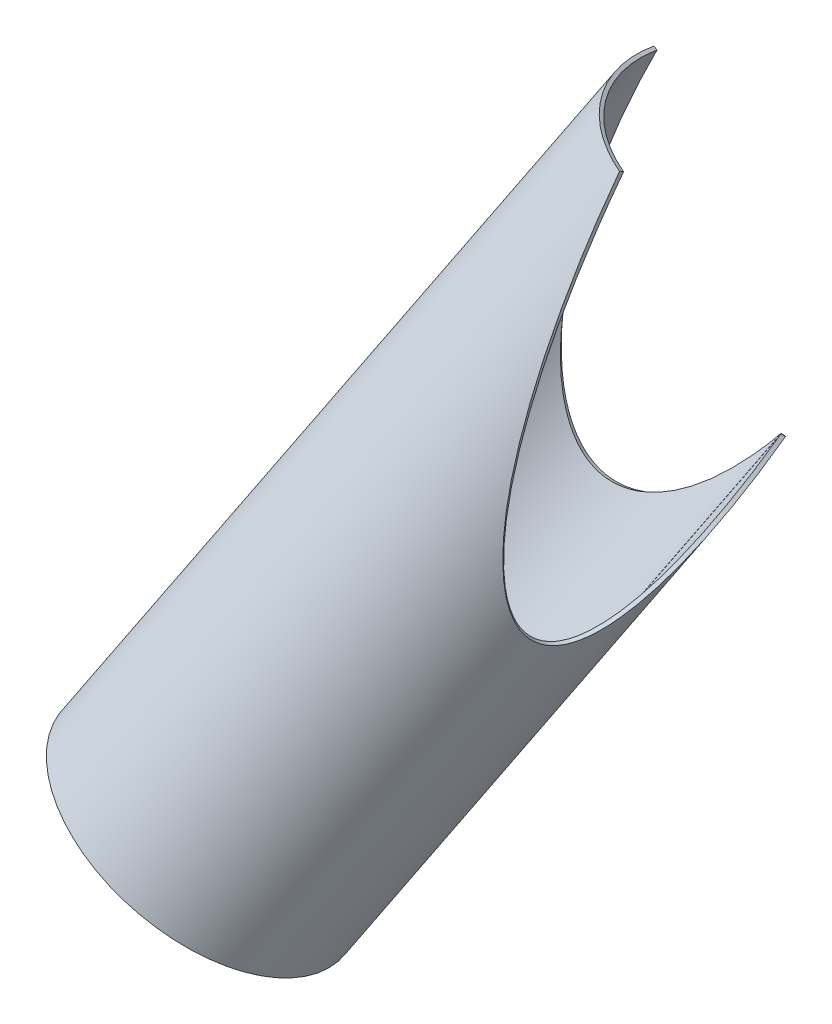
ISO-10303-21;
HEADER;
FILE_DESCRIPTION(('STEP AP214'),'2;1');
FILE_NAME('part.step','',(''),(''),'','','');
FILE_SCHEMA(('AUTOMOTIVE_DESIGN { 1 0 10303 214 1 1 1 1 }'));
ENDSEC;
DATA;
#1=APPLICATION_CONTEXT('core data for automotive mechanical design processes');
#2=APPLICATION_PROTOCOL_DEFINITION('international standard','automotive_design',2000,#1);
#3=PRODUCT_CONTEXT('',#1,'mechanical');
#4=PRODUCT('Part','Part','',(#3));
#5=PRODUCT_RELATED_PRODUCT_CATEGORY('part','',(#4));
#6=PRODUCT_DEFINITION_FORMATION('','',#4);
#7=PRODUCT_DEFINITION_CONTEXT('part definition',#1,'design');
#8=PRODUCT_DEFINITION('design','',#6,#7);
#9=PRODUCT_DEFINITION_SHAPE('','',#8);
#10=(LENGTH_UNIT() NAMED_UNIT(*) SI_UNIT(.MILLI.,.METRE.));
#11=(NAMED_UNIT(*) PLANE_ANGLE_UNIT() SI_UNIT($,.RADIAN.));
#12=(NAMED_UNIT(*) SI_UNIT($,.STERADIAN.) SOLID_ANGLE_UNIT());
#13=UNCERTAINTY_MEASURE_WITH_UNIT(LENGTH_MEASURE(1.E-05),#10,'distance_accuracy_value','');
#14=(GEOMETRIC_REPRESENTATION_CONTEXT(3) GLOBAL_UNCERTAINTY_ASSIGNED_CONTEXT((#13)) GLOBAL_UNIT_ASSIGNED_CONTEXT((#10,
#11,#12)) REPRESENTATION_CONTEXT('',''));
#15=CARTESIAN_POINT('',(0.,0.,0.));
#16=DIRECTION('',(0.,0.,1.));
#17=DIRECTION('',(1.,0.,0.));
#18=AXIS2_PLACEMENT_3D('',#15,#16,#17);
#19=CARTESIAN_POINT('',(-0.262865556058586,-380.940704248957,0.809016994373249));
#20=CARTESIAN_POINT('',(-1.10380528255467,-384.254979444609,3.39955945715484));
#21=CARTESIAN_POINT('',(-1.92145216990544,-387.441205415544,5.91479719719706));
#22=CARTESIAN_POINT('',(-3.11010227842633,-392.031085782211,9.57197509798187));
#23=CARTESIAN_POINT('',(-3.49820962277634,-393.522740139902,10.76638864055));
#24=CARTESIAN_POINT('',(-4.27279644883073,-396.486041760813,13.1503200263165));
#25=CARTESIAN_POINT('',(-4.65903041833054,-397.956616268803,14.3390279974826));
#26=CARTESIAN_POINT('',(-6.58481034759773,-405.254275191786,20.2659762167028));
#27=CARTESIAN_POINT('',(-8.10805494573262,-410.915366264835,24.9540757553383));
#28=CARTESIAN_POINT('',(-11.1223992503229,-421.90569335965,34.2312944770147));
#29=CARTESIAN_POINT('',(-12.6121829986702,-427.230021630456,38.8162091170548));
#30=CARTESIAN_POINT('',(-15.5597061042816,-437.558876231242,47.8880150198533));
#31=CARTESIAN_POINT('',(-17.0188977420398,-442.568370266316,52.3793816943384));
#32=CARTESIAN_POINT('',(-21.3504951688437,-457.136614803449,65.7112929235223));
#33=CARTESIAN_POINT('',(-24.1770400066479,-466.235124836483,74.4094957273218));
#34=CARTESIAN_POINT('',(-29.692619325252,-483.229381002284,91.3843135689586));
#35=CARTESIAN_POINT('',(-32.3899836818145,-491.151099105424,99.6862996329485));
#36=CARTESIAN_POINT('',(-40.2989830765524,-513.26159048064,124.026544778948));
#37=CARTESIAN_POINT('',(-45.3470636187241,-525.852411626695,139.563931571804));
#38=CARTESIAN_POINT('',(-52.5494540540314,-541.642713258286,161.731581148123));
#39=CARTESIAN_POINT('',(-54.8883359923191,-546.388984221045,168.929305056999));
#40=CARTESIAN_POINT('',(-59.4330682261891,-554.862267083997,182.915789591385));
#41=CARTESIAN_POINT('',(-61.638615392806,-558.589546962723,189.704717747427));
#42=CARTESIAN_POINT('',(-65.9244136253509,-565.066782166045,202.895319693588));
#43=CARTESIAN_POINT('',(-68.001850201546,-567.812203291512,209.287973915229));
#44=CARTESIAN_POINT('',(-72.0247494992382,-572.336346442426,221.669136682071));
#45=CARTESIAN_POINT('',(-73.9710584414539,-574.115603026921,227.659874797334));
#46=CARTESIAN_POINT('',(-79.6052994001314,-578.022564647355,245.000074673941));
#47=CARTESIAN_POINT('',(-83.0898784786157,-578.720025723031,255.7249727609));
#48=CARTESIAN_POINT('',(-89.4831853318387,-576.392324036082,275.400702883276));
#49=CARTESIAN_POINT('',(-92.38888883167,-573.368956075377,284.343730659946));
#50=CARTESIAN_POINT('',(-97.5944178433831,-563.671420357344,300.364891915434));
#51=CARTESIAN_POINT('',(-99.8929341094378,-556.999313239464,307.438685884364));
#52=CARTESIAN_POINT('',(-103.846665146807,-540.040310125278,319.607248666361));
#53=CARTESIAN_POINT('',(-105.502474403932,-529.748465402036,324.704052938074));
#54=CARTESIAN_POINT('',(-107.47092884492,-511.605346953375,330.761875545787));
#55=CARTESIAN_POINT('',(-108.04075947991,-505.112394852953,332.51507125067));
#56=CARTESIAN_POINT('',(-109.002339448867,-491.215155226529,335.474820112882));
#57=CARTESIAN_POINT('',(-109.394185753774,-483.812510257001,336.680830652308));
#58=CARTESIAN_POINT('',(-109.99243311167,-468.112238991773,338.522007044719));
#59=CARTESIAN_POINT('',(-110.199015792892,-459.804156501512,339.158296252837));
#60=CARTESIAN_POINT('',(-110.419921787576,-442.276615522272,339.837662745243));
#61=CARTESIAN_POINT('',(-110.434027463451,-433.058884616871,339.880867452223));
#62=CARTESIAN_POINT('',(-110.260015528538,-413.676032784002,339.345547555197));
#63=CARTESIAN_POINT('',(-110.072337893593,-403.522656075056,338.767636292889));
#64=CARTESIAN_POINT('',(-109.483046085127,-382.239616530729,336.954412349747));
#65=CARTESIAN_POINT('',(-109.082358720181,-371.12326858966,335.720645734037));
#66=CARTESIAN_POINT('',(-108.052087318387,-347.871883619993,332.550918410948));
#67=CARTESIAN_POINT('',(-107.423330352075,-335.744645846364,330.615699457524));
#68=CARTESIAN_POINT('',(-106.300260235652,-316.817791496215,327.158559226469));
#69=CARTESIAN_POINT('',(-105.896137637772,-310.390678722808,325.914763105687));
#70=CARTESIAN_POINT('',(-105.023433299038,-297.254773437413,323.22942112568));
#71=CARTESIAN_POINT('',(-104.555124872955,-290.549505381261,321.788460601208));
#72=CARTESIAN_POINT('',(-103.552786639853,-276.867768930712,318.703651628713));
#73=CARTESIAN_POINT('',(-103.018757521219,-269.891300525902,317.059802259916));
#74=CARTESIAN_POINT('',(-101.882743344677,-255.670824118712,313.562902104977));
#75=CARTESIAN_POINT('',(-101.281439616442,-248.435225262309,311.712150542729));
#76=CARTESIAN_POINT('',(-99.3642924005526,-226.244011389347,305.812664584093));
#77=CARTESIAN_POINT('',(-97.9368882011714,-210.817050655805,301.419377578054));
#78=CARTESIAN_POINT('',(-95.9514297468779,-190.767402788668,295.308138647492));
#79=CARTESIAN_POINT('',(-95.5446017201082,-186.722671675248,294.056020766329));
#80=CARTESIAN_POINT('',(-94.7076753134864,-178.531366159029,291.480485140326));
#81=CARTESIAN_POINT('',(-94.277761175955,-174.386537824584,290.157568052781));
#82=CARTESIAN_POINT('',(-92.9530063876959,-161.805850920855,286.080878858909));
#83=CARTESIAN_POINT('',(-92.0231899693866,-153.223769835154,283.219171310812));
#84=CARTESIAN_POINT('',(-90.5552221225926,-140.063880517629,278.700708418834));
#85=CARTESIAN_POINT('',(-90.0536832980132,-135.629461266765,277.156903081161));
#86=CARTESIAN_POINT('',(-89.0255156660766,-126.666050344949,273.992313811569));
#87=CARTESIAN_POINT('',(-88.4988853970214,-122.137061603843,272.371623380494));
#88=CARTESIAN_POINT('',(-86.8701375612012,-108.323091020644,267.35955890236));
#89=CARTESIAN_POINT('',(-85.7226423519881,-98.8401394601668,263.82838528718));
#90=CARTESIAN_POINT('',(-83.903765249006,-84.2146212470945,258.229980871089));
#91=CARTESIAN_POINT('',(-83.2811833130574,-79.2726106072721,256.313568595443));
#92=CARTESIAN_POINT('',(-82.0023665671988,-69.2566032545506,252.377333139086));
#93=CARTESIAN_POINT('',(-81.3479146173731,-64.196128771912,250.36308916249));
#94=CARTESIAN_POINT('',(-79.3076365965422,-48.6322287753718,244.084693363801));
#95=CARTESIAN_POINT('',(-77.8511981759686,-37.7934208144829,239.602933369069));
#96=CARTESIAN_POINT('',(-75.5115116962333,-20.8601990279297,232.401200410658));
#97=CARTESIAN_POINT('',(-74.7057352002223,-15.1033193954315,229.920757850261));
#98=CARTESIAN_POINT('',(-73.6647056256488,-7.76886530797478,226.716645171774));
#99=CARTESIAN_POINT('',(-73.4551984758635,-6.29775448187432,226.071840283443));
#100=CARTESIAN_POINT('',(-73.0283537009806,-3.31121146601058,224.758310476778));
#101=CARTESIAN_POINT('',(-72.8114848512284,-1.79905230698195,224.091006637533));
#102=CARTESIAN_POINT('',(-72.150437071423,2.79386958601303,222.057057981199));
#103=CARTESIAN_POINT('',(-71.6958198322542,5.93107933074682,220.658378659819));
#104=CARTESIAN_POINT('',(-69.351614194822,21.9903699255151,213.445647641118));
#105=CARTESIAN_POINT('',(-67.249817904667,36.0329403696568,206.97436698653));
#106=CARTESIAN_POINT('',(-64.8935688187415,51.2248383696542,199.721868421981));
#107=CARTESIAN_POINT('',(-4.31633599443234,-377.624088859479,3.73637753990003));
#108=CARTESIAN_POINT('',(-5.18409764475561,-380.93842421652,6.28984826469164));
#109=CARTESIAN_POINT('',(-6.02742285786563,-384.124997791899,8.7688515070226));
#110=CARTESIAN_POINT('',(-7.25295738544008,-388.715755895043,12.373011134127));
#111=CARTESIAN_POINT('',(-7.6530347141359,-390.207760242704,13.55005174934));
#112=CARTESIAN_POINT('',(-8.45136536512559,-393.171881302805,15.8992008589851));
#113=CARTESIAN_POINT('',(-8.84936400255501,-394.642925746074,17.0705108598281));
#114=CARTESIAN_POINT('',(-10.8334336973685,-401.943230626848,22.9104437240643));
#115=CARTESIAN_POINT('',(-12.4016004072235,-407.607385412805,27.5288554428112));
#116=CARTESIAN_POINT('',(-15.5025793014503,-418.605629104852,36.6665273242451));
#117=CARTESIAN_POINT('',(-17.034035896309,-423.934806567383,41.1816469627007));
#118=CARTESIAN_POINT('',(-20.0618250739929,-434.275051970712,50.1137608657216));
#119=CARTESIAN_POINT('',(-21.5596482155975,-439.291094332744,54.5351606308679));
#120=CARTESIAN_POINT('',(-26.0027003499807,-453.881412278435,67.6570535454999));
#121=CARTESIAN_POINT('',(-28.8976252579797,-462.997875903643,76.2150917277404));
#122=CARTESIAN_POINT('',(-34.5385510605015,-480.03381402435,92.9104786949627));
#123=CARTESIAN_POINT('',(-37.2930732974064,-487.979318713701,101.07278564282));
#124=CARTESIAN_POINT('',(-45.3577646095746,-510.169289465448,124.994889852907));
#125=CARTESIAN_POINT('',(-50.4890238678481,-522.824137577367,140.253574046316));
#126=CARTESIAN_POINT('',(-57.7869429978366,-538.72476400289,162.006777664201));
#127=CARTESIAN_POINT('',(-60.1527815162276,-543.510184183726,169.066988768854));
#128=CARTESIAN_POINT('',(-64.7419171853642,-552.066083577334,182.780461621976));
#129=CARTESIAN_POINT('',(-66.9649216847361,-555.836826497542,189.433887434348));
#130=CARTESIAN_POINT('',(-71.2764846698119,-562.405190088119,202.355300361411));
#131=CARTESIAN_POINT('',(-73.3622072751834,-565.198216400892,208.614451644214));
#132=CARTESIAN_POINT('',(-77.3927243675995,-569.821477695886,220.730910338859));
#133=CARTESIAN_POINT('',(-79.3383606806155,-571.652268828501,226.590397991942));
#134=CARTESIAN_POINT('',(-84.9574038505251,-575.719256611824,243.541079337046));
#135=CARTESIAN_POINT('',(-88.4142843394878,-576.530698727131,254.011761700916));
#136=CARTESIAN_POINT('',(-94.7183544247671,-574.443602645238,273.193208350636));
#137=CARTESIAN_POINT('',(-97.5625755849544,-571.546751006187,281.896369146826));
#138=CARTESIAN_POINT('',(-102.612374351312,-562.113242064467,297.454696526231));
#139=CARTESIAN_POINT('',(-104.816676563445,-555.57857990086,304.305645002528));
#140=CARTESIAN_POINT('',(-108.549978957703,-538.903865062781,316.048456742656));
#141=CARTESIAN_POINT('',(-110.079515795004,-528.758928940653,320.942267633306));
#142=CARTESIAN_POINT('',(-111.834943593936,-510.842025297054,326.713098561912));
#143=CARTESIAN_POINT('',(-112.329892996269,-504.425387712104,328.373627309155));
#144=CARTESIAN_POINT('',(-113.133808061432,-490.682608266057,331.154222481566));
#145=CARTESIAN_POINT('',(-113.442883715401,-483.358091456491,332.273773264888));
#146=CARTESIAN_POINT('',(-113.867929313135,-467.815499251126,333.948924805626));
#147=CARTESIAN_POINT('',(-113.983970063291,-459.58706956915,334.505540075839));
#148=CARTESIAN_POINT('',(-114.016020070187,-442.220154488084,335.032869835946));
#149=CARTESIAN_POINT('',(-113.931835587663,-433.083380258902,335.003720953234));
#150=CARTESIAN_POINT('',(-113.553197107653,-413.863749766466,334.331413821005));
#151=CARTESIAN_POINT('',(-113.259300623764,-403.792544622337,333.688945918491));
#152=CARTESIAN_POINT('',(-112.44933685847,-382.675007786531,331.754968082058));
#153=CARTESIAN_POINT('',(-111.934323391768,-371.641896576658,330.465071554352));
#154=CARTESIAN_POINT('',(-110.666870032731,-348.558009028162,327.192198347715));
#155=CARTESIAN_POINT('',(-109.915324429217,-336.514978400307,325.21000823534));
#156=CARTESIAN_POINT('',(-108.602046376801,-317.714656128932,321.690136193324));
#157=CARTESIAN_POINT('',(-108.133563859,-311.329728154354,320.426727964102));
#158=CARTESIAN_POINT('',(-107.129792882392,-298.278435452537,317.704768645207));
#159=CARTESIAN_POINT('',(-106.594811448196,-291.61557185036,316.246816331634));
#160=CARTESIAN_POINT('',(-105.45689950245,-278.018742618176,313.130837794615));
#161=CARTESIAN_POINT('',(-104.853969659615,-271.084776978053,311.472810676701));
#162=CARTESIAN_POINT('',(-103.577990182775,-256.949299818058,307.950549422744));
#163=CARTESIAN_POINT('',(-102.905705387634,-249.756149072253,306.088623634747));
#164=CARTESIAN_POINT('',(-100.771603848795,-227.692616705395,300.160271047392));
#165=CARTESIAN_POINT('',(-99.1943272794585,-212.351150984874,295.753987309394));
#166=CARTESIAN_POINT('',(-97.015399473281,-192.408122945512,289.635576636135));
#167=CARTESIAN_POINT('',(-96.5696055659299,-188.38468487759,288.382478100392));
#168=CARTESIAN_POINT('',(-95.6538989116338,-180.236055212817,285.805918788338));
#169=CARTESIAN_POINT('',(-95.1841868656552,-176.112600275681,284.482960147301));
#170=CARTESIAN_POINT('',(-93.7388338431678,-163.596102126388,280.407628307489));
#171=CARTESIAN_POINT('',(-92.727011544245,-155.056905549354,277.548801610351));
#172=CARTESIAN_POINT('',(-91.1337178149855,-141.961319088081,273.03791047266));
#173=CARTESIAN_POINT('',(-90.5900177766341,-137.548329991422,271.49717082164));
#174=CARTESIAN_POINT('',(-89.4767746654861,-128.627742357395,268.339844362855));
#175=CARTESIAN_POINT('',(-88.907230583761,-124.120147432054,266.723348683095));
#176=CARTESIAN_POINT('',(-87.147818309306,-110.370659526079,261.725742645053));
#177=CARTESIAN_POINT('',(-85.9109214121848,-100.930960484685,258.206685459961));
#178=CARTESIAN_POINT('',(-83.9546505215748,-86.370449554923,252.630656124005));
#179=CARTESIAN_POINT('',(-83.2857226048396,-81.450129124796,250.722402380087));
#180=CARTESIAN_POINT('',(-81.9131484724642,-71.477496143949,246.803965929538));
#181=CARTESIAN_POINT('',(-81.2114115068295,-66.438649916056,244.799331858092));
#182=CARTESIAN_POINT('',(-79.0259858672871,-50.940331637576,238.552510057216));
#183=CARTESIAN_POINT('',(-77.468824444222,-40.1459698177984,234.095387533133));
#184=CARTESIAN_POINT('',(-74.9724208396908,-23.2799532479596,226.936988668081));
#185=CARTESIAN_POINT('',(-74.1134677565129,-17.5455638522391,224.472054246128));
#186=CARTESIAN_POINT('',(-73.0048371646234,-10.2392692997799,221.288762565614));
#187=CARTESIAN_POINT('',(-72.7817780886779,-8.77378255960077,220.648185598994));
#188=CARTESIAN_POINT('',(-72.3274372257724,-5.7986062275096,219.343347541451));
#189=CARTESIAN_POINT('',(-72.0966542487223,-4.29217707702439,218.680498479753));
#190=CARTESIAN_POINT('',(-71.3933687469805,0.283421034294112,216.660252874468));
#191=CARTESIAN_POINT('',(-70.9099324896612,3.4089031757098,215.271160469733));
#192=CARTESIAN_POINT('',(-68.4183726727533,19.4087513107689,208.108786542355));
#193=CARTESIAN_POINT('',(-66.1882317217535,33.4011748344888,201.685519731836));
#194=CARTESIAN_POINT('',(-63.6939753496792,48.5416325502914,194.491057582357));
#195=B_SPLINE_SURFACE_WITH_KNOTS('',1,3,((#19,#20,#21,#22,#23,#24,#25,#26,#27,#28,#29,#30,#31,
#32,#33,#34,#35,#36,#37,#38,#39,#40,#41,#42,#43,#44,#45,#46,#47,#48,#49,#50,#51,#52,#53,#54,#55,
#56,#57,#58,#59,#60,#61,#62,#63,#64,#65,#66,#67,#68,#69,#70,#71,#72,#73,#74,#75,#76,#77,#78,#79,
#80,#81,#82,#83,#84,#85,#86,#87,#88,#89,#90,#91,#92,#93,#94,#95,#96,#97,#98,#99,#100,#101,#102,
#103,#104,#105,#106),(#107,#108,#109,#110,#111,#112,#113,#114,#115,#116,#117,#118,#119,#120,
#121,#122,#123,#124,#125,#126,#127,#128,#129,#130,#131,#132,#133,#134,#135,#136,#137,#138,#139,
#140,#141,#142,#143,#144,#145,#146,#147,#148,#149,#150,#151,#152,#153,#154,#155,#156,#157,#158,
#159,#160,#161,#162,#163,#164,#165,#166,#167,#168,#169,#170,#171,#172,#173,#174,#175,#176,#177,
#178,#179,#180,#181,#182,#183,#184,#185,#186,#187,#188,#189,#190,#191,#192,#193,#194)),
.UNSPECIFIED.,.F.,.F.,.F.,(2,2),(4,2,2,2,2,2,2,2,2,2,2,2,2,2,2,2,2,2,2,2,2,2,2,2,2,2,2,2,2,2,2,
2,2,2,2,2,2,2,2,2,2,2,2,4),(0.,1.),(0.,0.0078125,0.01171875,0.015625,0.03125,0.046875,0.0625,
0.09375,0.125,0.1875,0.21875,0.25,0.28125,0.3125,0.375,0.4375,0.5,0.5625,0.59375,0.625,0.65625,
0.6875,0.71875,0.75,0.78125,0.796875,0.8125,0.828125,0.84375,0.875,0.8828125,0.890625,0.90625,
0.9140625,0.921875,0.9375,0.9453125,0.953125,0.96875,0.9765625,0.978515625,0.98046875,0.984375,
1.),.UNSPECIFIED.);
#196=CARTESIAN_POINT('',(-0.262865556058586,-380.940704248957,0.809016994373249));
#197=CARTESIAN_POINT('',(-4.31633599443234,-377.624088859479,3.73637753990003));
#198=B_SPLINE_CURVE_WITH_KNOTS('',1,(#196,#197),.UNSPECIFIED.,.F.,.F.,(2,2),(0.,1.),.UNSPECIFIED.);
#199=CARTESIAN_POINT('',(-4.31633599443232,-377.624088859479,3.73637753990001));
#200=VERTEX_POINT('',#199);
#201=CARTESIAN_POINT('',(-0.262865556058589,-380.940704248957,0.809016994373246));
#202=VERTEX_POINT('',#201);
#203=EDGE_CURVE('E13',#200,#202,#198,.F.);
#204=CARTESIAN_POINT('',(-4.31633599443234,-377.624088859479,3.73637753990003));
#205=CARTESIAN_POINT('',(-5.18409764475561,-380.93842421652,6.28984826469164));
#206=CARTESIAN_POINT('',(-6.02742285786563,-384.124997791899,8.7688515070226));
#207=CARTESIAN_POINT('',(-7.25295738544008,-388.715755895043,12.373011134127));
#208=CARTESIAN_POINT('',(-7.6530347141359,-390.207760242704,13.55005174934));
#209=CARTESIAN_POINT('',(-8.45136536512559,-393.171881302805,15.8992008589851));
#210=CARTESIAN_POINT('',(-8.84936400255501,-394.642925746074,17.0705108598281));
#211=CARTESIAN_POINT('',(-10.8334336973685,-401.943230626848,22.9104437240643));
#212=CARTESIAN_POINT('',(-12.4016004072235,-407.607385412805,27.5288554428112));
#213=CARTESIAN_POINT('',(-15.5025793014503,-418.605629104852,36.6665273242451));
#214=CARTESIAN_POINT('',(-17.034035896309,-423.934806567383,41.1816469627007));
#215=CARTESIAN_POINT('',(-20.0618250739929,-434.275051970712,50.1137608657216));
#216=CARTESIAN_POINT('',(-21.5596482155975,-439.291094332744,54.5351606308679));
#217=CARTESIAN_POINT('',(-26.0027003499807,-453.881412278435,67.6570535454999));
#218=CARTESIAN_POINT('',(-28.8976252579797,-462.997875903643,76.2150917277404));
#219=CARTESIAN_POINT('',(-34.5385510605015,-480.03381402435,92.9104786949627));
#220=CARTESIAN_POINT('',(-37.2930732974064,-487.979318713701,101.07278564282));
#221=CARTESIAN_POINT('',(-45.3577646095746,-510.169289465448,124.994889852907));
#222=CARTESIAN_POINT('',(-50.4890238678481,-522.824137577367,140.253574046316));
#223=CARTESIAN_POINT('',(-57.7869429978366,-538.72476400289,162.006777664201));
#224=CARTESIAN_POINT('',(-60.1527815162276,-543.510184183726,169.066988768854));
#225=CARTESIAN_POINT('',(-64.7419171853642,-552.066083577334,182.780461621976));
#226=CARTESIAN_POINT('',(-66.9649216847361,-555.836826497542,189.433887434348));
#227=CARTESIAN_POINT('',(-71.2764846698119,-562.405190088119,202.355300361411));
#228=CARTESIAN_POINT('',(-73.3622072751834,-565.198216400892,208.614451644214));
#229=CARTESIAN_POINT('',(-77.3927243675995,-569.821477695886,220.730910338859));
#230=CARTESIAN_POINT('',(-79.3383606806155,-571.652268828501,226.590397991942));
#231=CARTESIAN_POINT('',(-84.9574038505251,-575.719256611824,243.541079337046));
#232=CARTESIAN_POINT('',(-88.4142843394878,-576.530698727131,254.011761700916));
#233=CARTESIAN_POINT('',(-94.7183544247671,-574.443602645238,273.193208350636));
#234=CARTESIAN_POINT('',(-97.5625755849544,-571.546751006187,281.896369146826));
#235=CARTESIAN_POINT('',(-102.612374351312,-562.113242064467,297.454696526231));
#236=CARTESIAN_POINT('',(-104.816676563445,-555.57857990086,304.305645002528));
#237=CARTESIAN_POINT('',(-108.549978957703,-538.903865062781,316.048456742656));
#238=CARTESIAN_POINT('',(-110.079515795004,-528.758928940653,320.942267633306));
#239=CARTESIAN_POINT('',(-111.834943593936,-510.842025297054,326.713098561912));
#240=CARTESIAN_POINT('',(-112.329892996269,-504.425387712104,328.373627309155));
#241=CARTESIAN_POINT('',(-113.133808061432,-490.682608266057,331.154222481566));
#242=CARTESIAN_POINT('',(-113.442883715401,-483.358091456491,332.273773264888));
#243=CARTESIAN_POINT('',(-113.867929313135,-467.815499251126,333.948924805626));
#244=CARTESIAN_POINT('',(-113.983970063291,-459.58706956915,334.505540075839));
#245=CARTESIAN_POINT('',(-114.016020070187,-442.220154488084,335.032869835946));
#246=CARTESIAN_POINT('',(-113.931835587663,-433.083380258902,335.003720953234));
#247=CARTESIAN_POINT('',(-113.553197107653,-413.863749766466,334.331413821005));
#248=CARTESIAN_POINT('',(-113.259300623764,-403.792544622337,333.688945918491));
#249=CARTESIAN_POINT('',(-112.44933685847,-382.675007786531,331.754968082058));
#250=CARTESIAN_POINT('',(-111.934323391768,-371.641896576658,330.465071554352));
#251=CARTESIAN_POINT('',(-110.666870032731,-348.558009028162,327.192198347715));
#252=CARTESIAN_POINT('',(-109.915324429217,-336.514978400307,325.21000823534));
#253=CARTESIAN_POINT('',(-108.602046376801,-317.714656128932,321.690136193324));
#254=CARTESIAN_POINT('',(-108.133563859,-311.329728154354,320.426727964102));
#255=CARTESIAN_POINT('',(-107.129792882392,-298.278435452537,317.704768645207));
#256=CARTESIAN_POINT('',(-106.594811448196,-291.61557185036,316.246816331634));
#257=CARTESIAN_POINT('',(-105.45689950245,-278.018742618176,313.130837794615));
#258=CARTESIAN_POINT('',(-104.853969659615,-271.084776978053,311.472810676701));
#259=CARTESIAN_POINT('',(-103.577990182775,-256.949299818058,307.950549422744));
#260=CARTESIAN_POINT('',(-102.905705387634,-249.756149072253,306.088623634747));
#261=CARTESIAN_POINT('',(-100.771603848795,-227.692616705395,300.160271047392));
#262=CARTESIAN_POINT('',(-99.1943272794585,-212.351150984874,295.753987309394));
#263=CARTESIAN_POINT('',(-97.015399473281,-192.408122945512,289.635576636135));
#264=CARTESIAN_POINT('',(-96.5696055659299,-188.38468487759,288.382478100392));
#265=CARTESIAN_POINT('',(-95.6538989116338,-180.236055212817,285.805918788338));
#266=CARTESIAN_POINT('',(-95.1841868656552,-176.112600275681,284.482960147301));
#267=CARTESIAN_POINT('',(-93.7388338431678,-163.596102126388,280.407628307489));
#268=CARTESIAN_POINT('',(-92.727011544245,-155.056905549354,277.548801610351));
#269=CARTESIAN_POINT('',(-91.1337178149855,-141.961319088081,273.03791047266));
#270=CARTESIAN_POINT('',(-90.5900177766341,-137.548329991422,271.49717082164));
#271=CARTESIAN_POINT('',(-89.4767746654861,-128.627742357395,268.339844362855));
#272=CARTESIAN_POINT('',(-88.907230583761,-124.120147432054,266.723348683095));
#273=CARTESIAN_POINT('',(-87.147818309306,-110.370659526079,261.725742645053));
#274=CARTESIAN_POINT('',(-85.9109214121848,-100.930960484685,258.206685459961));
#275=CARTESIAN_POINT('',(-83.9546505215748,-86.370449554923,252.630656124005));
#276=CARTESIAN_POINT('',(-83.2857226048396,-81.450129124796,250.722402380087));
#277=CARTESIAN_POINT('',(-81.9131484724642,-71.477496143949,246.803965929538));
#278=CARTESIAN_POINT('',(-81.2114115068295,-66.438649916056,244.799331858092));
#279=CARTESIAN_POINT('',(-79.0259858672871,-50.940331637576,238.552510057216));
#280=CARTESIAN_POINT('',(-77.468824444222,-40.1459698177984,234.095387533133));
#281=CARTESIAN_POINT('',(-74.9724208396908,-23.2799532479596,226.936988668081));
#282=CARTESIAN_POINT('',(-74.1134677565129,-17.5455638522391,224.472054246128));
#283=CARTESIAN_POINT('',(-73.0048371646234,-10.2392692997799,221.288762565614));
#284=CARTESIAN_POINT('',(-72.7817780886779,-8.77378255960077,220.648185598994));
#285=CARTESIAN_POINT('',(-72.3274372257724,-5.7986062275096,219.343347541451));
#286=CARTESIAN_POINT('',(-72.0966542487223,-4.29217707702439,218.680498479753));
#287=CARTESIAN_POINT('',(-71.3933687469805,0.283421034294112,216.660252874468));
#288=CARTESIAN_POINT('',(-70.9099324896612,3.4089031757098,215.271160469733));
#289=CARTESIAN_POINT('',(-68.4183726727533,19.4087513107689,208.108786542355));
#290=CARTESIAN_POINT('',(-66.1882317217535,33.4011748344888,201.685519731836));
#291=CARTESIAN_POINT('',(-63.6939753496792,48.5416325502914,194.491057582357));
#292=B_SPLINE_CURVE_WITH_KNOTS('',3,(#204,#205,#206,#207,#208,#209,#210,#211,#212,#213,#214,
#215,#216,#217,#218,#219,#220,#221,#222,#223,#224,#225,#226,#227,#228,#229,#230,#231,#232,#233,
#234,#235,#236,#237,#238,#239,#240,#241,#242,#243,#244,#245,#246,#247,#248,#249,#250,#251,#252,
#253,#254,#255,#256,#257,#258,#259,#260,#261,#262,#263,#264,#265,#266,#267,#268,#269,#270,#271,
#272,#273,#274,#275,#276,#277,#278,#279,#280,#281,#282,#283,#284,#285,#286,#287,#288,#289,#290,
#291),.UNSPECIFIED.,.F.,.F.,(4,2,2,2,2,2,2,2,2,2,2,2,2,2,2,2,2,2,2,2,2,2,2,2,2,2,2,2,2,2,2,2,2,
2,2,2,2,2,2,2,2,2,2,4),(0.,0.0078125,0.01171875,0.015625,0.03125,0.046875,0.0625,0.09375,0.125,
0.1875,0.21875,0.25,0.28125,0.3125,0.375,0.4375,0.5,0.5625,0.59375,0.625,0.65625,0.6875,0.71875,
0.75,0.78125,0.796875,0.8125,0.828125,0.84375,0.875,0.8828125,0.890625,0.90625,0.9140625,
0.921875,0.9375,0.9453125,0.953125,0.96875,0.9765625,0.978515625,0.98046875,0.984375,1.),.UNSPECIFIED.);
#293=CARTESIAN_POINT('',(-63.6939753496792,48.5416325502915,194.491057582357));
#294=VERTEX_POINT('',#293);
#295=EDGE_CURVE('E104',#200,#294,#292,.T.);
#296=CARTESIAN_POINT('',(-63.6939753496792,48.5416325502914,194.491057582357));
#297=CARTESIAN_POINT('',(-64.8935688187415,51.2248383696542,199.721868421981));
#298=B_SPLINE_CURVE_WITH_KNOTS('',1,(#296,#297),.UNSPECIFIED.,.F.,.F.,(2,2),(0.,1.),.UNSPECIFIED.);
#299=CARTESIAN_POINT('',(-64.8935688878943,51.2248379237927,199.721868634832));
#300=VERTEX_POINT('',#299);
#301=EDGE_CURVE('E51',#294,#300,#298,.T.);
#302=CARTESIAN_POINT('',(-64.8935688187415,51.2248383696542,199.721868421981));
#303=CARTESIAN_POINT('',(-67.249817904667,36.0329403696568,206.97436698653));
#304=CARTESIAN_POINT('',(-69.351614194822,21.9903699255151,213.445647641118));
#305=CARTESIAN_POINT('',(-71.6958198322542,5.93107933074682,220.658378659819));
#306=CARTESIAN_POINT('',(-72.150437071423,2.79386958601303,222.057057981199));
#307=CARTESIAN_POINT('',(-72.8114848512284,-1.79905230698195,224.091006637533));
#308=CARTESIAN_POINT('',(-73.0283537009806,-3.31121146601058,224.758310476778));
#309=CARTESIAN_POINT('',(-73.4551984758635,-6.29775448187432,226.071840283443));
#310=CARTESIAN_POINT('',(-73.6647056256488,-7.76886530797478,226.716645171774));
#311=CARTESIAN_POINT('',(-74.7057352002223,-15.1033193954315,229.920757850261));
#312=CARTESIAN_POINT('',(-75.5115116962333,-20.8601990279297,232.401200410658));
#313=CARTESIAN_POINT('',(-77.8511981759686,-37.7934208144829,239.602933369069));
#314=CARTESIAN_POINT('',(-79.3076365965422,-48.6322287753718,244.084693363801));
#315=CARTESIAN_POINT('',(-81.3479146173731,-64.196128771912,250.36308916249));
#316=CARTESIAN_POINT('',(-82.0023665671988,-69.2566032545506,252.377333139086));
#317=CARTESIAN_POINT('',(-83.2811833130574,-79.2726106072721,256.313568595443));
#318=CARTESIAN_POINT('',(-83.903765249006,-84.2146212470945,258.229980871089));
#319=CARTESIAN_POINT('',(-85.7226423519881,-98.8401394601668,263.82838528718));
#320=CARTESIAN_POINT('',(-86.8701375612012,-108.323091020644,267.35955890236));
#321=CARTESIAN_POINT('',(-88.4988853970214,-122.137061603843,272.371623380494));
#322=CARTESIAN_POINT('',(-89.0255156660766,-126.666050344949,273.992313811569));
#323=CARTESIAN_POINT('',(-90.0536832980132,-135.629461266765,277.156903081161));
#324=CARTESIAN_POINT('',(-90.5552221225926,-140.063880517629,278.700708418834));
#325=CARTESIAN_POINT('',(-92.0231899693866,-153.223769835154,283.219171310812));
#326=CARTESIAN_POINT('',(-92.9530063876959,-161.805850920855,286.080878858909));
#327=CARTESIAN_POINT('',(-94.277761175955,-174.386537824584,290.157568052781));
#328=CARTESIAN_POINT('',(-94.7076753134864,-178.531366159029,291.480485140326));
#329=CARTESIAN_POINT('',(-95.5446017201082,-186.722671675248,294.056020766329));
#330=CARTESIAN_POINT('',(-95.9514297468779,-190.767402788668,295.308138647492));
#331=CARTESIAN_POINT('',(-97.9368882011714,-210.817050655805,301.419377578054));
#332=CARTESIAN_POINT('',(-99.3642924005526,-226.244011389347,305.812664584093));
#333=CARTESIAN_POINT('',(-101.281439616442,-248.435225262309,311.712150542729));
#334=CARTESIAN_POINT('',(-101.882743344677,-255.670824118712,313.562902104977));
#335=CARTESIAN_POINT('',(-103.018757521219,-269.891300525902,317.059802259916));
#336=CARTESIAN_POINT('',(-103.552786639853,-276.867768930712,318.703651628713));
#337=CARTESIAN_POINT('',(-104.555124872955,-290.549505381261,321.788460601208));
#338=CARTESIAN_POINT('',(-105.023433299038,-297.254773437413,323.22942112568));
#339=CARTESIAN_POINT('',(-105.896137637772,-310.390678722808,325.914763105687));
#340=CARTESIAN_POINT('',(-106.300260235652,-316.817791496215,327.158559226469));
#341=CARTESIAN_POINT('',(-107.423330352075,-335.744645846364,330.615699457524));
#342=CARTESIAN_POINT('',(-108.052087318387,-347.871883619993,332.550918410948));
#343=CARTESIAN_POINT('',(-109.082358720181,-371.12326858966,335.720645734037));
#344=CARTESIAN_POINT('',(-109.483046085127,-382.239616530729,336.954412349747));
#345=CARTESIAN_POINT('',(-110.072337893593,-403.522656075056,338.767636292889));
#346=CARTESIAN_POINT('',(-110.260015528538,-413.676032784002,339.345547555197));
#347=CARTESIAN_POINT('',(-110.434027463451,-433.058884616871,339.880867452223));
#348=CARTESIAN_POINT('',(-110.419921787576,-442.276615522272,339.837662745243));
#349=CARTESIAN_POINT('',(-110.199015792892,-459.804156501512,339.158296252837));
#350=CARTESIAN_POINT('',(-109.99243311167,-468.112238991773,338.522007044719));
#351=CARTESIAN_POINT('',(-109.394185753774,-483.812510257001,336.680830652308));
#352=CARTESIAN_POINT('',(-109.002339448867,-491.215155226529,335.474820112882));
#353=CARTESIAN_POINT('',(-108.04075947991,-505.112394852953,332.51507125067));
#354=CARTESIAN_POINT('',(-107.47092884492,-511.605346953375,330.761875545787));
#355=CARTESIAN_POINT('',(-105.502474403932,-529.748465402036,324.704052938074));
#356=CARTESIAN_POINT('',(-103.846665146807,-540.040310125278,319.607248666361));
#357=CARTESIAN_POINT('',(-99.8929341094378,-556.999313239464,307.438685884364));
#358=CARTESIAN_POINT('',(-97.5944178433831,-563.671420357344,300.364891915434));
#359=CARTESIAN_POINT('',(-92.38888883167,-573.368956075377,284.343730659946));
#360=CARTESIAN_POINT('',(-89.4831853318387,-576.392324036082,275.400702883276));
#361=CARTESIAN_POINT('',(-83.0898784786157,-578.720025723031,255.7249727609));
#362=CARTESIAN_POINT('',(-79.6052994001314,-578.022564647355,245.000074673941));
#363=CARTESIAN_POINT('',(-73.9710584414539,-574.115603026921,227.659874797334));
#364=CARTESIAN_POINT('',(-72.0247494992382,-572.336346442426,221.669136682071));
#365=CARTESIAN_POINT('',(-68.001850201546,-567.812203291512,209.287973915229));
#366=CARTESIAN_POINT('',(-65.9244136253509,-565.066782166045,202.895319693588));
#367=CARTESIAN_POINT('',(-61.638615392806,-558.589546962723,189.704717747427));
#368=CARTESIAN_POINT('',(-59.4330682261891,-554.862267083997,182.915789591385));
#369=CARTESIAN_POINT('',(-54.8883359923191,-546.388984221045,168.929305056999));
#370=CARTESIAN_POINT('',(-52.5494540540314,-541.642713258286,161.731581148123));
#371=CARTESIAN_POINT('',(-45.3470636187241,-525.852411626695,139.563931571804));
#372=CARTESIAN_POINT('',(-40.2989830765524,-513.26159048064,124.026544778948));
#373=CARTESIAN_POINT('',(-32.3899836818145,-491.151099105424,99.6862996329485));
#374=CARTESIAN_POINT('',(-29.692619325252,-483.229381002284,91.3843135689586));
#375=CARTESIAN_POINT('',(-24.1770400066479,-466.235124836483,74.4094957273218));
#376=CARTESIAN_POINT('',(-21.3504951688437,-457.136614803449,65.7112929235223));
#377=CARTESIAN_POINT('',(-17.0188977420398,-442.568370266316,52.3793816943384));
#378=CARTESIAN_POINT('',(-15.5597061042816,-437.558876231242,47.8880150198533));
#379=CARTESIAN_POINT('',(-12.6121829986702,-427.230021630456,38.8162091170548));
#380=CARTESIAN_POINT('',(-11.1223992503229,-421.90569335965,34.2312944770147));
#381=CARTESIAN_POINT('',(-8.10805494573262,-410.915366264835,24.9540757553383));
#382=CARTESIAN_POINT('',(-6.58481034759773,-405.254275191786,20.2659762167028));
#383=CARTESIAN_POINT('',(-4.65903041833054,-397.956616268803,14.3390279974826));
#384=CARTESIAN_POINT('',(-4.27279644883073,-396.486041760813,13.1503200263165));
#385=CARTESIAN_POINT('',(-3.49820962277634,-393.522740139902,10.76638864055));
#386=CARTESIAN_POINT('',(-3.11010227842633,-392.031085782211,9.57197509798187));
#387=CARTESIAN_POINT('',(-1.92145216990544,-387.441205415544,5.91479719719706));
#388=CARTESIAN_POINT('',(-1.10380528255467,-384.254979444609,3.39955945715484));
#389=CARTESIAN_POINT('',(-0.262865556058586,-380.940704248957,0.809016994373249));
#390=B_SPLINE_CURVE_WITH_KNOTS('',3,(#302,#303,#304,#305,#306,#307,#308,#309,#310,#311,#312,
#313,#314,#315,#316,#317,#318,#319,#320,#321,#322,#323,#324,#325,#326,#327,#328,#329,#330,#331,
#332,#333,#334,#335,#336,#337,#338,#339,#340,#341,#342,#343,#344,#345,#346,#347,#348,#349,#350,
#351,#352,#353,#354,#355,#356,#357,#358,#359,#360,#361,#362,#363,#364,#365,#366,#367,#368,#369,
#370,#371,#372,#373,#374,#375,#376,#377,#378,#379,#380,#381,#382,#383,#384,#385,#386,#387,#388,
#389),.UNSPECIFIED.,.F.,.F.,(4,2,2,2,2,2,2,2,2,2,2,2,2,2,2,2,2,2,2,2,2,2,2,2,2,2,2,2,2,2,2,2,2,
2,2,2,2,2,2,2,2,2,2,4),(0.,0.015625,0.01953125,0.021484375,0.0234375,0.03125,0.046875,0.0546875,
0.0625,0.078125,0.0859375,0.09375,0.109375,0.1171875,0.125,0.15625,0.171875,0.1875,0.203125,
0.21875,0.25,0.28125,0.3125,0.34375,0.375,0.40625,0.4375,0.5,0.5625,0.625,0.6875,0.71875,0.75,
0.78125,0.8125,0.875,0.90625,0.9375,0.953125,0.96875,0.984375,0.98828125,0.9921875,1.),.UNSPECIFIED.);
#391=EDGE_CURVE('E102',#202,#300,#390,.F.);
#392=ORIENTED_EDGE('',*,*,#203,.F.);
#393=ORIENTED_EDGE('',*,*,#295,.T.);
#394=ORIENTED_EDGE('',*,*,#301,.T.);
#395=ORIENTED_EDGE('',*,*,#391,.F.);
#396=EDGE_LOOP('',(#392,#393,#394,#395));
#397=FACE_BOUND('',#396,.T.);
#398=ADVANCED_FACE('F40',(#397),#195,.T.);
#399=CARTESIAN_POINT('',(-209.999999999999,51.2248383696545,-2.86630528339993E-12));
#400=CARTESIAN_POINT('',(-209.999508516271,51.5031277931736,1.56474524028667));
#401=CARTESIAN_POINT('',(-209.982610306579,51.7438906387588,2.9511952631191));
#402=CARTESIAN_POINT('',(-209.955809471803,51.9778247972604,4.30928575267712));
#403=CARTESIAN_POINT('',(-209.952720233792,52.0033031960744,4.45738431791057));
#404=CARTESIAN_POINT('',(-209.94794303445,52.0407612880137,4.67532954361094));
#405=CARTESIAN_POINT('',(-209.945976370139,52.0558195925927,4.76298845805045));
#406=CARTESIAN_POINT('',(-209.942009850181,52.0852831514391,4.93468583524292));
#407=CARTESIAN_POINT('',(-209.939975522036,52.0999909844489,5.02047177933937));
#408=CARTESIAN_POINT('',(-209.929549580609,52.1734108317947,5.44908740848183));
#409=CARTESIAN_POINT('',(-209.92039507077,52.2317648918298,5.79097480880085));
#410=CARTESIAN_POINT('',(-209.900485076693,52.3477200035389,6.4727301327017));
#411=CARTESIAN_POINT('',(-209.889729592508,52.4053210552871,6.81259805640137));
#412=CARTESIAN_POINT('',(-209.866644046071,52.5197808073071,7.49030542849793));
#413=CARTESIAN_POINT('',(-209.854487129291,52.5758930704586,7.82369448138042));
#414=CARTESIAN_POINT('',(-209.788100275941,52.8620895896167,9.53005068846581));
#415=CARTESIAN_POINT('',(-209.721711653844,53.0875018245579,10.89328511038));
#416=CARTESIAN_POINT('',(-209.562577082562,53.5311509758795,13.6155573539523));
#417=CARTESIAN_POINT('',(-209.470188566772,53.7486630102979,14.9700126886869));
#418=CARTESIAN_POINT('',(-209.151655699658,54.3946669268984,19.0538436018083));
#419=CARTESIAN_POINT('',(-208.883901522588,54.8150811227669,21.794406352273));
#420=CARTESIAN_POINT('',(-208.405041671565,55.4204129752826,25.8689208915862));
#421=CARTESIAN_POINT('',(-208.232379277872,55.6183930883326,27.2236324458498));
#422=CARTESIAN_POINT('',(-207.954043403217,55.9096453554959,29.2501483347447));
#423=CARTESIAN_POINT('',(-207.858041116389,56.0057765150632,29.9247284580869));
#424=CARTESIAN_POINT('',(-207.70923032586,56.1485415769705,30.9351663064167));
#425=CARTESIAN_POINT('',(-207.65882550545,56.1958913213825,31.2717402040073));
#426=CARTESIAN_POINT('',(-207.556418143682,56.2901132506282,31.944403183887));
#427=CARTESIAN_POINT('',(-207.505416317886,56.3361015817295,32.2741269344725));
#428=CARTESIAN_POINT('',(-206.590820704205,57.1438923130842,38.0916686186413));
#429=CARTESIAN_POINT('',(-205.517047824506,57.8419348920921,43.5070600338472));
#430=CARTESIAN_POINT('',(-203.601267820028,58.7943126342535,51.5170546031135));
#431=CARTESIAN_POINT('',(-202.911834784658,59.0960045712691,54.1682202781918));
#432=CARTESIAN_POINT('',(-201.80333430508,59.5248445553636,58.1139725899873));
#433=CARTESIAN_POINT('',(-201.421443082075,59.6638423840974,59.4240583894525));
#434=CARTESIAN_POINT('',(-200.830264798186,59.8664173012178,61.3811058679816));
#435=CARTESIAN_POINT('',(-200.630148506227,59.932955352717,62.0321082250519));
#436=CARTESIAN_POINT('',(-200.325419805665,60.0312826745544,63.0065504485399));
#437=CARTESIAN_POINT('',(-200.223084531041,60.0638118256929,63.3310209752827));
#438=CARTESIAN_POINT('',(-200.01690110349,60.128377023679,63.9792681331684));
#439=CARTESIAN_POINT('',(-199.915050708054,60.1598059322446,64.2968677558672));
#440=CARTESIAN_POINT('',(-198.10285517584,60.7105501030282,69.9001240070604));
#441=CARTESIAN_POINT('',(-196.192496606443,61.1649862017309,75.0928117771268));
#442=CARTESIAN_POINT('',(-193.033686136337,61.7495058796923,82.7380523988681));
#443=CARTESIAN_POINT('',(-191.931884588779,61.9281691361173,85.2625133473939));
#444=CARTESIAN_POINT('',(-190.207739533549,62.1718511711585,89.0106007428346));
#445=CARTESIAN_POINT('',(-189.621118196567,62.249027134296,90.2535300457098));
#446=CARTESIAN_POINT('',(-188.723565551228,62.3587148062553,92.1079475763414));
#447=CARTESIAN_POINT('',(-188.421444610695,62.3942646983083,92.7244240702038));
#448=CARTESIAN_POINT('',(-187.811369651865,62.4633398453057,93.9539979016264));
#449=CARTESIAN_POINT('',(-187.506250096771,62.4965686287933,94.5615204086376));
#450=CARTESIAN_POINT('',(-182.173611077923,63.0543376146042,105.049770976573));
#451=CARTESIAN_POINT('',(-176.380904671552,63.317383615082,114.505850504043));
#452=CARTESIAN_POINT('',(-166.649894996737,63.3173817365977,127.899437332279));
#453=CARTESIAN_POINT('',(-163.227433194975,63.2518007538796,132.239740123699));
#454=CARTESIAN_POINT('',(-157.840323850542,63.0547229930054,138.542663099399));
#455=CARTESIAN_POINT('',(-156.002400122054,62.972591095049,140.609057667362));
#456=CARTESIAN_POINT('',(-153.184166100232,62.8247984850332,143.654215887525));
#457=CARTESIAN_POINT('',(-152.234530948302,62.7714358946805,144.66019697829));
#458=CARTESIAN_POINT('',(-150.794998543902,62.6852591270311,146.155246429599));
#459=CARTESIAN_POINT('',(-150.31264118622,62.6555114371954,146.651275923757));
#460=CARTESIAN_POINT('',(-149.342943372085,62.5939748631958,147.638642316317));
#461=CARTESIAN_POINT('',(-148.851153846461,62.5618879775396,148.134420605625));
#462=CARTESIAN_POINT('',(-144.482904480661,62.2692998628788,152.495131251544));
#463=CARTESIAN_POINT('',(-140.438048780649,61.9444086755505,156.229120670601));
#464=CARTESIAN_POINT('',(-134.143132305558,61.3599033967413,161.595854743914));
#465=CARTESIAN_POINT('',(-132.006905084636,61.148885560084,163.345731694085));
#466=CARTESIAN_POINT('',(-128.747748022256,60.8082006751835,165.909448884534));
#467=CARTESIAN_POINT('',(-127.652227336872,60.6906134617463,166.753838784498));
#468=CARTESIAN_POINT('',(-125.995511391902,60.5082157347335,168.00483666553));
#469=CARTESIAN_POINT('',(-125.441033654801,60.4464137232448,168.41923816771));
#470=CARTESIAN_POINT('',(-124.60599243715,60.3522096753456,169.036904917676));
#471=CARTESIAN_POINT('',(-124.327091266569,60.3205581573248,169.242137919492));
#472=CARTESIAN_POINT('',(-123.768186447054,60.2567553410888,169.65128565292));
#473=CARTESIAN_POINT('',(-123.482873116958,60.2239908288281,169.859047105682));
#474=CARTESIAN_POINT('',(-118.803753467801,59.6836002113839,173.248943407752));
#475=CARTESIAN_POINT('',(-114.254617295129,59.1118416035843,176.2837853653));
#476=CARTESIAN_POINT('',(-107.228684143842,58.1594812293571,180.581050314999));
#477=CARTESIAN_POINT('',(-104.853021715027,57.826253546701,181.970977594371));
#478=CARTESIAN_POINT('',(-101.241138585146,57.3028707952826,183.989492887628));
#479=CARTESIAN_POINT('',(-100.029113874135,57.1244871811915,184.651269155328));
#480=CARTESIAN_POINT('',(-98.1992596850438,56.8510503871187,185.627015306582));
#481=CARTESIAN_POINT('',(-97.587338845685,56.7589279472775,185.949444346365));
#482=CARTESIAN_POINT('',(-96.666538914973,56.6192823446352,186.428818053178));
#483=CARTESIAN_POINT('',(-96.3591191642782,56.5724901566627,186.587897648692));
#484=CARTESIAN_POINT('',(-95.7433127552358,56.4784190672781,186.904626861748));
#485=CARTESIAN_POINT('',(-95.4289905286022,56.4302269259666,187.065292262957));
#486=CARTESIAN_POINT('',(-92.70260668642,56.0107485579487,188.450531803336));
#487=CARTESIAN_POINT('',(-90.248489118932,55.6226031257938,189.638266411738));
#488=CARTESIAN_POINT('',(-86.5234860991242,55.0176312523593,191.351905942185));
#489=CARTESIAN_POINT('',(-85.2745152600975,54.8121825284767,191.911792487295));
#490=CARTESIAN_POINT('',(-83.3903871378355,54.4983500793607,192.734314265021));
#491=CARTESIAN_POINT('',(-82.7605658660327,54.3927960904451,193.005603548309));
#492=CARTESIAN_POINT('',(-81.4974142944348,54.1798070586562,193.542360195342));
#493=CARTESIAN_POINT('',(-80.8580563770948,54.0713434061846,193.810319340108));
#494=CARTESIAN_POINT('',(-78.9709578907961,53.7493111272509,194.590434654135));
#495=CARTESIAN_POINT('',(-77.7068563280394,53.531030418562,195.098696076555));
#496=CARTESIAN_POINT('',(-75.8019572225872,53.1982903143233,195.843121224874));
#497=CARTESIAN_POINT('',(-75.165533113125,53.0864904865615,196.088268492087));
#498=CARTESIAN_POINT('',(-73.8898212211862,52.8611301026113,196.572534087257));
#499=CARTESIAN_POINT('',(-73.2464615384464,52.7468422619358,196.813152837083));
#500=CARTESIAN_POINT('',(-71.9732183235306,52.5194275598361,197.282320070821));
#501=CARTESIAN_POINT('',(-71.3340116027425,52.4046399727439,197.514350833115));
#502=CARTESIAN_POINT('',(-70.3713499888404,52.2308222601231,197.858490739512));
#503=CARTESIAN_POINT('',(-70.0498208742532,52.1726103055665,197.972552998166));
#504=CARTESIAN_POINT('',(-69.6471099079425,52.0995028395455,198.114308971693));
#505=CARTESIAN_POINT('',(-69.5623228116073,52.0840985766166,198.144091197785));
#506=CARTESIAN_POINT('',(-69.4224165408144,52.0586690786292,198.193151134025));
#507=CARTESIAN_POINT('',(-69.351901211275,52.0458474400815,198.217835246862));
#508=CARTESIAN_POINT('',(-69.1386675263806,52.0070593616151,198.292345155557));
#509=CARTESIAN_POINT('',(-68.9942614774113,51.9807697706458,198.342628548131));
#510=CARTESIAN_POINT('',(-67.6743276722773,51.7402244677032,198.800550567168));
#511=CARTESIAN_POINT('',(-66.3568624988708,51.4984586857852,199.245931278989));
#512=CARTESIAN_POINT('',(-64.8935688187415,51.2248383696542,199.721868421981));
#513=CARTESIAN_POINT('',(-204.654508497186,48.5416325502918,0.475528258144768));
#514=CARTESIAN_POINT('',(-204.657561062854,48.8053928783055,1.99813117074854));
#515=CARTESIAN_POINT('',(-204.644241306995,49.0335082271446,3.34721747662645));
#516=CARTESIAN_POINT('',(-204.621200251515,49.2551793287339,4.66868067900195));
#517=CARTESIAN_POINT('',(-204.618525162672,49.2793225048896,4.81278462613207));
#518=CARTESIAN_POINT('',(-204.614363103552,49.314818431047,5.02485060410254));
#519=CARTESIAN_POINT('',(-204.61264496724,49.3290880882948,5.11014471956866));
#520=CARTESIAN_POINT('',(-204.60916818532,49.3570084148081,5.27720993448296));
#521=CARTESIAN_POINT('',(-204.607379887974,49.3709458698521,5.36068137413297));
#522=CARTESIAN_POINT('',(-204.59818987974,49.4405200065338,5.7777323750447));
#523=CARTESIAN_POINT('',(-204.590042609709,49.4958172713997,6.11039333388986));
#524=CARTESIAN_POINT('',(-204.572183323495,49.6056980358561,6.77374656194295));
#525=CARTESIAN_POINT('',(-204.562471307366,49.6602815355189,7.10443883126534));
#526=CARTESIAN_POINT('',(-204.541508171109,49.7687451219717,7.76384593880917));
#527=CARTESIAN_POINT('',(-204.530415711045,49.8219178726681,8.088230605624));
#528=CARTESIAN_POINT('',(-204.469582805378,50.0931224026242,9.74849087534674));
#529=CARTESIAN_POINT('',(-204.407970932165,50.3067277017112,11.074868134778));
#530=CARTESIAN_POINT('',(-204.259051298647,50.7271387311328,13.7234793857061));
#531=CARTESIAN_POINT('',(-204.172081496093,50.933257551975,15.0412550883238));
#532=CARTESIAN_POINT('',(-203.870904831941,51.5454210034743,19.0144029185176));
#533=CARTESIAN_POINT('',(-203.616171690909,51.9438149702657,21.6805660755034));
#534=CARTESIAN_POINT('',(-203.158727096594,52.5174406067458,25.6442846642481));
#535=CARTESIAN_POINT('',(-202.99352730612,52.7050507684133,26.9621278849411));
#536=CARTESIAN_POINT('',(-202.7268652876,52.9810469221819,28.9334470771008));
#537=CARTESIAN_POINT('',(-202.634834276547,53.0721425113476,29.5896459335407));
#538=CARTESIAN_POINT('',(-202.492099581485,53.2074289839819,30.5725396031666));
#539=CARTESIAN_POINT('',(-202.443739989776,53.2522983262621,30.8999367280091));
#540=CARTESIAN_POINT('',(-202.345462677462,53.34158438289,31.5542556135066));
#541=CARTESIAN_POINT('',(-202.296505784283,53.38516354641,31.8749857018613));
#542=CARTESIAN_POINT('',(-201.418365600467,54.1506361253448,37.5338128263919));
#543=CARTESIAN_POINT('',(-200.384185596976,54.8121245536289,42.8009549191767));
#544=CARTESIAN_POINT('',(-198.535307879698,55.7146213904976,50.5909314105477));
#545=CARTESIAN_POINT('',(-197.869427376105,56.0005110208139,53.1691499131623));
#546=CARTESIAN_POINT('',(-196.798078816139,56.406885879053,57.0061482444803));
#547=CARTESIAN_POINT('',(-196.428875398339,56.5386016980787,58.2800938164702));
#548=CARTESIAN_POINT('',(-195.85717756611,56.7305631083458,60.1831071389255));
#549=CARTESIAN_POINT('',(-195.663629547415,56.7936149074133,60.8161274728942));
#550=CARTESIAN_POINT('',(-195.368864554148,56.8867902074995,61.7636418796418));
#551=CARTESIAN_POINT('',(-195.269869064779,56.9176149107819,62.0791440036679));
#552=CARTESIAN_POINT('',(-195.070402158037,56.9787969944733,62.7094696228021));
#553=CARTESIAN_POINT('',(-194.97186365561,57.0085790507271,63.0182869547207));
#554=CARTESIAN_POINT('',(-193.218487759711,57.5304641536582,68.4665669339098));
#555=CARTESIAN_POINT('',(-191.368513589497,57.9611033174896,73.5151081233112));
#556=CARTESIAN_POINT('',(-188.307420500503,58.5150106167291,80.947337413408));
#557=CARTESIAN_POINT('',(-187.239381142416,58.6843165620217,83.4013289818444));
#558=CARTESIAN_POINT('',(-185.567610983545,58.9152342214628,87.0445903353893));
#559=CARTESIAN_POINT('',(-184.998736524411,58.9883673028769,88.2527239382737));
#560=CARTESIAN_POINT('',(-184.128230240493,59.0923084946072,90.0551767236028));
#561=CARTESIAN_POINT('',(-183.83519575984,59.1259958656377,90.6543697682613));
#562=CARTESIAN_POINT('',(-183.243434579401,59.1914518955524,91.8494545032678));
#563=CARTESIAN_POINT('',(-182.947457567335,59.2229396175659,92.4399278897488));
#564=CARTESIAN_POINT('',(-177.774311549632,59.7514824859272,102.63369577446));
#565=CARTESIAN_POINT('',(-172.150467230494,60.0007588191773,111.822040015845));
#566=CARTESIAN_POINT('',(-162.697486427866,60.000756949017,124.832952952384));
#567=CARTESIAN_POINT('',(-159.371970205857,59.9386132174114,129.048637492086));
#568=CARTESIAN_POINT('',(-154.136261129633,59.7518567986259,135.169648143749));
#569=CARTESIAN_POINT('',(-152.349800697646,59.6740259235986,137.176240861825));
#570=CARTESIAN_POINT('',(-149.61019978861,59.5339738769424,140.133022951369));
#571=CARTESIAN_POINT('',(-148.687015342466,59.4834062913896,141.109766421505));
#572=CARTESIAN_POINT('',(-147.287511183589,59.4017438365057,142.561300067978));
#573=CARTESIAN_POINT('',(-146.818555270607,59.3735545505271,143.042881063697));
#574=CARTESIAN_POINT('',(-145.875776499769,59.3152419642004,144.001465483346));
#575=CARTESIAN_POINT('',(-145.397627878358,59.2848362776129,144.482780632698));
#576=CARTESIAN_POINT('',(-141.150444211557,59.0075797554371,148.716181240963));
#577=CARTESIAN_POINT('',(-137.217004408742,58.6997070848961,152.340469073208));
#578=CARTESIAN_POINT('',(-131.094477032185,58.1458137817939,157.548443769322));
#579=CARTESIAN_POINT('',(-129.016589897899,57.9458469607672,159.246366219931));
#580=CARTESIAN_POINT('',(-125.846199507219,57.6230058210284,161.733672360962));
#581=CARTESIAN_POINT('',(-124.780477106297,57.5115777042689,162.552845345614));
#582=CARTESIAN_POINT('',(-123.168765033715,57.3387347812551,163.766406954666));
#583=CARTESIAN_POINT('',(-122.629339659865,57.2801703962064,164.168394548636));
#584=CARTESIAN_POINT('',(-121.816952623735,57.190901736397,164.767538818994));
#585=CARTESIAN_POINT('',(-121.545615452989,57.1609085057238,164.96661405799));
#586=CARTESIAN_POINT('',(-121.001863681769,57.1004485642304,165.363479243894));
#587=CARTESIAN_POINT('',(-120.724283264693,57.0694007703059,165.56500030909));
#588=CARTESIAN_POINT('',(-116.171943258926,56.5573253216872,168.853022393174));
#589=CARTESIAN_POINT('',(-111.745475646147,56.015518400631,171.795845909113));
#590=CARTESIAN_POINT('',(-104.908117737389,55.1130384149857,175.961492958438));
#591=CARTESIAN_POINT('',(-102.596075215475,54.7972626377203,177.30861574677));
#592=CARTESIAN_POINT('',(-99.0807031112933,54.3012919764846,179.264601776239));
#593=CARTESIAN_POINT('',(-97.9010289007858,54.13225140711,179.905814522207));
#594=CARTESIAN_POINT('',(-96.1199627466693,53.8731370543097,180.851144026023));
#595=CARTESIAN_POINT('',(-95.5243482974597,53.7858400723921,181.163505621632));
#596=CARTESIAN_POINT('',(-94.6280725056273,53.6535095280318,181.627886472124));
#597=CARTESIAN_POINT('',(-94.3288382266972,53.6091685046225,181.781986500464));
#598=CARTESIAN_POINT('',(-93.7294241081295,53.520025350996,182.088792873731));
#599=CARTESIAN_POINT('',(-93.4234666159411,53.4743578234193,182.244420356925));
#600=CARTESIAN_POINT('',(-90.7696181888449,53.0768549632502,183.586186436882));
#601=CARTESIAN_POINT('',(-88.3806591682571,52.70904039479,184.736382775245));
#602=CARTESIAN_POINT('',(-84.754355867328,52.135755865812,186.395445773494));
#603=CARTESIAN_POINT('',(-83.5384452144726,51.9410680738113,186.937428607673));
#604=CARTESIAN_POINT('',(-81.7041397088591,51.6436739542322,187.733536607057));
#605=CARTESIAN_POINT('',(-81.0909646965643,51.5436488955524,187.996094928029));
#606=CARTESIAN_POINT('',(-79.8611817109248,51.3418165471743,188.5155384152));
#607=CARTESIAN_POINT('',(-79.2387051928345,51.2390345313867,188.774834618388));
#608=CARTESIAN_POINT('',(-77.4014084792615,50.9338718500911,189.529670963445));
#609=CARTESIAN_POINT('',(-76.1706352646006,50.7270245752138,190.021384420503));
#610=CARTESIAN_POINT('',(-74.3159106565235,50.4117131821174,190.741451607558));
#611=CARTESIAN_POINT('',(-73.6962417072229,50.3057693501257,190.978556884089));
#612=CARTESIAN_POINT('',(-72.4540993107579,50.0922134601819,191.446894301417));
#613=CARTESIAN_POINT('',(-71.8276610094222,49.9839122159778,191.679577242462));
#614=CARTESIAN_POINT('',(-70.5878900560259,49.7684104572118,192.133228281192));
#615=CARTESIAN_POINT('',(-69.9654794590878,49.6596360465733,192.357563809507));
#616=CARTESIAN_POINT('',(-69.0281012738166,49.4949236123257,192.690257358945));
#617=CARTESIAN_POINT('',(-68.7150148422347,49.4397610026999,192.800520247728));
#618=CARTESIAN_POINT('',(-68.3228757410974,49.3704830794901,192.937547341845));
#619=CARTESIAN_POINT('',(-68.2403143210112,49.3558856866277,192.966335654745));
#620=CARTESIAN_POINT('',(-68.1040803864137,49.3317883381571,193.013757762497));
#621=CARTESIAN_POINT('',(-68.0354158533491,49.3196385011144,193.037617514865));
#622=CARTESIAN_POINT('',(-67.8277784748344,49.2828830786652,193.109638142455));
#623=CARTESIAN_POINT('',(-67.6871618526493,49.2579715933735,193.158240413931));
#624=CARTESIAN_POINT('',(-66.4018606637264,49.0300380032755,193.600841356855));
#625=CARTESIAN_POINT('',(-65.1189325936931,48.8009653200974,194.031241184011));
#626=CARTESIAN_POINT('',(-63.6939753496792,48.5416325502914,194.491057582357));
#627=B_SPLINE_SURFACE_WITH_KNOTS('',1,3,((#399,#400,#401,#402,#403,#404,#405,#406,#407,#408,
#409,#410,#411,#412,#413,#414,#415,#416,#417,#418,#419,#420,#421,#422,#423,#424,#425,#426,#427,
#428,#429,#430,#431,#432,#433,#434,#435,#436,#437,#438,#439,#440,#441,#442,#443,#444,#445,#446,
#447,#448,#449,#450,#451,#452,#453,#454,#455,#456,#457,#458,#459,#460,#461,#462,#463,#464,#465,
#466,#467,#468,#469,#470,#471,#472,#473,#474,#475,#476,#477,#478,#479,#480,#481,#482,#483,#484,
#485,#486,#487,#488,#489,#490,#491,#492,#493,#494,#495,#496,#497,#498,#499,#500,#501,#502,#503,
#504,#505,#506,#507,#508,#509,#510,#511,#512),(#513,#514,#515,#516,#517,#518,#519,#520,#521,
#522,#523,#524,#525,#526,#527,#528,#529,#530,#531,#532,#533,#534,#535,#536,#537,#538,#539,#540,
#541,#542,#543,#544,#545,#546,#547,#548,#549,#550,#551,#552,#553,#554,#555,#556,#557,#558,#559,
#560,#561,#562,#563,#564,#565,#566,#567,#568,#569,#570,#571,#572,#573,#574,#575,#576,#577,#578,
#579,#580,#581,#582,#583,#584,#585,#586,#587,#588,#589,#590,#591,#592,#593,#594,#595,#596,#597,
#598,#599,#600,#601,#602,#603,#604,#605,#606,#607,#608,#609,#610,#611,#612,#613,#614,#615,#616,
#617,#618,#619,#620,#621,#622,#623,#624,#625,#626)),.UNSPECIFIED.,.F.,.F.,.F.,(2,2),(4,2,2,2,2,
2,2,2,2,2,2,2,2,2,2,2,2,2,2,2,2,2,2,2,2,2,2,2,2,2,2,2,2,2,2,2,2,2,2,2,2,2,2,2,2,2,2,2,2,2,2,2,2,
2,2,2,4),(0.,1.),(0.,0.015625,0.017578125,0.0185546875,0.01953125,0.0234375,0.02734375,0.03125,
0.046875,0.0625,0.09375,0.109375,0.1171875,0.12109375,0.125,0.1875,0.21875,0.234375,0.2421875,
0.24609375,0.25,0.3125,0.34375,0.359375,0.3671875,0.375,0.5,0.5625,0.59375,0.609375,0.6171875,
0.625,0.6875,0.71875,0.734375,0.7421875,0.74609375,0.75,0.8125,0.84375,0.859375,0.8671875,
0.87109375,0.875,0.90625,0.921875,0.9296875,0.9375,0.953125,0.9609375,0.96875,0.9765625,
0.98046875,0.9814453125,0.982421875,0.984375,1.),.UNSPECIFIED.);
#628=CARTESIAN_POINT('',(-63.6939753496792,48.5416325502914,194.491057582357));
#629=CARTESIAN_POINT('',(-65.1189325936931,48.8009653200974,194.031241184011));
#630=CARTESIAN_POINT('',(-66.4018606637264,49.0300380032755,193.600841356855));
#631=CARTESIAN_POINT('',(-67.6871618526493,49.2579715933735,193.158240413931));
#632=CARTESIAN_POINT('',(-67.8277784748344,49.2828830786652,193.109638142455));
#633=CARTESIAN_POINT('',(-68.0354158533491,49.3196385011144,193.037617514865));
#634=CARTESIAN_POINT('',(-68.1040803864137,49.3317883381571,193.013757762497));
#635=CARTESIAN_POINT('',(-68.2403143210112,49.3558856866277,192.966335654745));
#636=CARTESIAN_POINT('',(-68.3228757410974,49.3704830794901,192.937547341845));
#637=CARTESIAN_POINT('',(-68.7150148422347,49.4397610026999,192.800520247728));
#638=CARTESIAN_POINT('',(-69.0281012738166,49.4949236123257,192.690257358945));
#639=CARTESIAN_POINT('',(-69.9654794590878,49.6596360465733,192.357563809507));
#640=CARTESIAN_POINT('',(-70.5878900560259,49.7684104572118,192.133228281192));
#641=CARTESIAN_POINT('',(-71.8276610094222,49.9839122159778,191.679577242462));
#642=CARTESIAN_POINT('',(-72.4540993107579,50.0922134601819,191.446894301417));
#643=CARTESIAN_POINT('',(-73.6962417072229,50.3057693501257,190.978556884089));
#644=CARTESIAN_POINT('',(-74.3159106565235,50.4117131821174,190.741451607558));
#645=CARTESIAN_POINT('',(-76.1706352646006,50.7270245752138,190.021384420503));
#646=CARTESIAN_POINT('',(-77.4014084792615,50.9338718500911,189.529670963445));
#647=CARTESIAN_POINT('',(-79.2387051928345,51.2390345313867,188.774834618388));
#648=CARTESIAN_POINT('',(-79.8611817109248,51.3418165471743,188.5155384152));
#649=CARTESIAN_POINT('',(-81.0909646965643,51.5436488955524,187.996094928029));
#650=CARTESIAN_POINT('',(-81.7041397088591,51.6436739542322,187.733536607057));
#651=CARTESIAN_POINT('',(-83.5384452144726,51.9410680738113,186.937428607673));
#652=CARTESIAN_POINT('',(-84.754355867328,52.135755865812,186.395445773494));
#653=CARTESIAN_POINT('',(-88.3806591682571,52.70904039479,184.736382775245));
#654=CARTESIAN_POINT('',(-90.7696181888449,53.0768549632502,183.586186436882));
#655=CARTESIAN_POINT('',(-93.4234666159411,53.4743578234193,182.244420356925));
#656=CARTESIAN_POINT('',(-93.7294241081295,53.520025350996,182.088792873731));
#657=CARTESIAN_POINT('',(-94.3288382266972,53.6091685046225,181.781986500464));
#658=CARTESIAN_POINT('',(-94.6280725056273,53.6535095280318,181.627886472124));
#659=CARTESIAN_POINT('',(-95.5243482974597,53.7858400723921,181.163505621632));
#660=CARTESIAN_POINT('',(-96.1199627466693,53.8731370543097,180.851144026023));
#661=CARTESIAN_POINT('',(-97.9010289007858,54.13225140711,179.905814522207));
#662=CARTESIAN_POINT('',(-99.0807031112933,54.3012919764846,179.264601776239));
#663=CARTESIAN_POINT('',(-102.596075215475,54.7972626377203,177.30861574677));
#664=CARTESIAN_POINT('',(-104.908117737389,55.1130384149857,175.961492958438));
#665=CARTESIAN_POINT('',(-111.745475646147,56.015518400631,171.795845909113));
#666=CARTESIAN_POINT('',(-116.171943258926,56.5573253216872,168.853022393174));
#667=CARTESIAN_POINT('',(-120.724283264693,57.0694007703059,165.56500030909));
#668=CARTESIAN_POINT('',(-121.001863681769,57.1004485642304,165.363479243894));
#669=CARTESIAN_POINT('',(-121.545615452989,57.1609085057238,164.96661405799));
#670=CARTESIAN_POINT('',(-121.816952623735,57.190901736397,164.767538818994));
#671=CARTESIAN_POINT('',(-122.629339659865,57.2801703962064,164.168394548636));
#672=CARTESIAN_POINT('',(-123.168765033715,57.3387347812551,163.766406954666));
#673=CARTESIAN_POINT('',(-124.780477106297,57.5115777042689,162.552845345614));
#674=CARTESIAN_POINT('',(-125.846199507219,57.6230058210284,161.733672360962));
#675=CARTESIAN_POINT('',(-129.016589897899,57.9458469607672,159.246366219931));
#676=CARTESIAN_POINT('',(-131.094477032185,58.1458137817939,157.548443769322));
#677=CARTESIAN_POINT('',(-137.217004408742,58.6997070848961,152.340469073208));
#678=CARTESIAN_POINT('',(-141.150444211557,59.0075797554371,148.716181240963));
#679=CARTESIAN_POINT('',(-145.397627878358,59.2848362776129,144.482780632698));
#680=CARTESIAN_POINT('',(-145.875776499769,59.3152419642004,144.001465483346));
#681=CARTESIAN_POINT('',(-146.818555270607,59.3735545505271,143.042881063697));
#682=CARTESIAN_POINT('',(-147.287511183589,59.4017438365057,142.561300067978));
#683=CARTESIAN_POINT('',(-148.687015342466,59.4834062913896,141.109766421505));
#684=CARTESIAN_POINT('',(-149.61019978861,59.5339738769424,140.133022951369));
#685=CARTESIAN_POINT('',(-152.349800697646,59.6740259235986,137.176240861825));
#686=CARTESIAN_POINT('',(-154.136261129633,59.7518567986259,135.169648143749));
#687=CARTESIAN_POINT('',(-159.371970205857,59.9386132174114,129.048637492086));
#688=CARTESIAN_POINT('',(-162.697486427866,60.000756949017,124.832952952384));
#689=CARTESIAN_POINT('',(-172.150467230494,60.0007588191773,111.822040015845));
#690=CARTESIAN_POINT('',(-177.774311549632,59.7514824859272,102.63369577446));
#691=CARTESIAN_POINT('',(-182.947457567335,59.2229396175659,92.4399278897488));
#692=CARTESIAN_POINT('',(-183.243434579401,59.1914518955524,91.8494545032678));
#693=CARTESIAN_POINT('',(-183.83519575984,59.1259958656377,90.6543697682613));
#694=CARTESIAN_POINT('',(-184.128230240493,59.0923084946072,90.0551767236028));
#695=CARTESIAN_POINT('',(-184.998736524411,58.9883673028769,88.2527239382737));
#696=CARTESIAN_POINT('',(-185.567610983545,58.9152342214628,87.0445903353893));
#697=CARTESIAN_POINT('',(-187.239381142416,58.6843165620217,83.4013289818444));
#698=CARTESIAN_POINT('',(-188.307420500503,58.5150106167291,80.947337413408));
#699=CARTESIAN_POINT('',(-191.368513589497,57.9611033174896,73.5151081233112));
#700=CARTESIAN_POINT('',(-193.218487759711,57.5304641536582,68.4665669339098));
#701=CARTESIAN_POINT('',(-194.97186365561,57.0085790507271,63.0182869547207));
#702=CARTESIAN_POINT('',(-195.070402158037,56.9787969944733,62.7094696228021));
#703=CARTESIAN_POINT('',(-195.269869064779,56.9176149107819,62.0791440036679));
#704=CARTESIAN_POINT('',(-195.368864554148,56.8867902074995,61.7636418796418));
#705=CARTESIAN_POINT('',(-195.663629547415,56.7936149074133,60.8161274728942));
#706=CARTESIAN_POINT('',(-195.85717756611,56.7305631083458,60.1831071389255));
#707=CARTESIAN_POINT('',(-196.428875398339,56.5386016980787,58.2800938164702));
#708=CARTESIAN_POINT('',(-196.798078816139,56.406885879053,57.0061482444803));
#709=CARTESIAN_POINT('',(-197.869427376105,56.0005110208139,53.1691499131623));
#710=CARTESIAN_POINT('',(-198.535307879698,55.7146213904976,50.5909314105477));
#711=CARTESIAN_POINT('',(-200.384185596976,54.8121245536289,42.8009549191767));
#712=CARTESIAN_POINT('',(-201.418365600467,54.1506361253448,37.5338128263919));
#713=CARTESIAN_POINT('',(-202.296505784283,53.38516354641,31.8749857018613));
#714=CARTESIAN_POINT('',(-202.345462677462,53.34158438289,31.5542556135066));
#715=CARTESIAN_POINT('',(-202.443739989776,53.2522983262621,30.8999367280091));
#716=CARTESIAN_POINT('',(-202.492099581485,53.2074289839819,30.5725396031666));
#717=CARTESIAN_POINT('',(-202.634834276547,53.0721425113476,29.5896459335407));
#718=CARTESIAN_POINT('',(-202.7268652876,52.9810469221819,28.9334470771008));
#719=CARTESIAN_POINT('',(-202.99352730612,52.7050507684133,26.9621278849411));
#720=CARTESIAN_POINT('',(-203.158727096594,52.5174406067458,25.6442846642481));
#721=CARTESIAN_POINT('',(-203.616171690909,51.9438149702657,21.6805660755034));
#722=CARTESIAN_POINT('',(-203.870904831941,51.5454210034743,19.0144029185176));
#723=CARTESIAN_POINT('',(-204.172081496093,50.933257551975,15.0412550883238));
#724=CARTESIAN_POINT('',(-204.259051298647,50.7271387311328,13.7234793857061));
#725=CARTESIAN_POINT('',(-204.407970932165,50.3067277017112,11.074868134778));
#726=CARTESIAN_POINT('',(-204.469582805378,50.0931224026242,9.74849087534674));
#727=CARTESIAN_POINT('',(-204.530415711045,49.8219178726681,8.088230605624));
#728=CARTESIAN_POINT('',(-204.541508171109,49.7687451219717,7.76384593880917));
#729=CARTESIAN_POINT('',(-204.562471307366,49.6602815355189,7.10443883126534));
#730=CARTESIAN_POINT('',(-204.572183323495,49.6056980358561,6.77374656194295));
#731=CARTESIAN_POINT('',(-204.590042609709,49.4958172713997,6.11039333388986));
#732=CARTESIAN_POINT('',(-204.59818987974,49.4405200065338,5.7777323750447));
#733=CARTESIAN_POINT('',(-204.607379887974,49.3709458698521,5.36068137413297));
#734=CARTESIAN_POINT('',(-204.60916818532,49.3570084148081,5.27720993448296));
#735=CARTESIAN_POINT('',(-204.61264496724,49.3290880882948,5.11014471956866));
#736=CARTESIAN_POINT('',(-204.614363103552,49.314818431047,5.02485060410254));
#737=CARTESIAN_POINT('',(-204.618525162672,49.2793225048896,4.81278462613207));
#738=CARTESIAN_POINT('',(-204.621200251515,49.2551793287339,4.66868067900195));
#739=CARTESIAN_POINT('',(-204.644241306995,49.0335082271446,3.34721747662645));
#740=CARTESIAN_POINT('',(-204.657561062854,48.8053928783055,1.99813117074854));
#741=CARTESIAN_POINT('',(-204.654508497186,48.5416325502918,0.475528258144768));
#742=B_SPLINE_CURVE_WITH_KNOTS('',3,(#628,#629,#630,#631,#632,#633,#634,#635,#636,#637,#638,
#639,#640,#641,#642,#643,#644,#645,#646,#647,#648,#649,#650,#651,#652,#653,#654,#655,#656,#657,
#658,#659,#660,#661,#662,#663,#664,#665,#666,#667,#668,#669,#670,#671,#672,#673,#674,#675,#676,
#677,#678,#679,#680,#681,#682,#683,#684,#685,#686,#687,#688,#689,#690,#691,#692,#693,#694,#695,
#696,#697,#698,#699,#700,#701,#702,#703,#704,#705,#706,#707,#708,#709,#710,#711,#712,#713,#714,
#715,#716,#717,#718,#719,#720,#721,#722,#723,#724,#725,#726,#727,#728,#729,#730,#731,#732,#733,
#734,#735,#736,#737,#738,#739,#740,#741),.UNSPECIFIED.,.F.,.F.,(4,2,2,2,2,2,2,2,2,2,2,2,2,2,2,2,
2,2,2,2,2,2,2,2,2,2,2,2,2,2,2,2,2,2,2,2,2,2,2,2,2,2,2,2,2,2,2,2,2,2,2,2,2,2,2,2,4),(0.,0.015625,
0.017578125,0.0185546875,0.01953125,0.0234375,0.03125,0.0390625,0.046875,0.0625,0.0703125,
0.078125,0.09375,0.125,0.12890625,0.1328125,0.140625,0.15625,0.1875,0.25,0.25390625,0.2578125,
0.265625,0.28125,0.3125,0.375,0.3828125,0.390625,0.40625,0.4375,0.5,0.625,0.6328125,0.640625,
0.65625,0.6875,0.75,0.75390625,0.7578125,0.765625,0.78125,0.8125,0.875,0.87890625,0.8828125,
0.890625,0.90625,0.9375,0.953125,0.96875,0.97265625,0.9765625,0.98046875,0.9814453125,
0.982421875,0.984375,1.),.UNSPECIFIED.);
#743=CARTESIAN_POINT('',(-204.654508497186,48.5416325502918,0.475528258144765));
#744=VERTEX_POINT('',#743);
#745=EDGE_CURVE('E197',#744,#294,#742,.F.);
#746=CARTESIAN_POINT('',(-204.654508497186,48.5416325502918,0.475528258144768));
#747=CARTESIAN_POINT('',(-209.999999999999,51.2248383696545,-2.86630528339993E-12));
#748=B_SPLINE_CURVE_WITH_KNOTS('',1,(#746,#747),.UNSPECIFIED.,.F.,.F.,(2,2),(0.,1.),.UNSPECIFIED.);
#749=CARTESIAN_POINT('',(-209.999999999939,51.2248384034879,1.90234897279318E-07));
#750=VERTEX_POINT('',#749);
#751=EDGE_CURVE('E111',#744,#750,#748,.T.);
#752=CARTESIAN_POINT('',(-209.999999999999,51.2248383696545,-2.86630528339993E-12));
#753=CARTESIAN_POINT('',(-209.999508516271,51.5031277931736,1.56474524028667));
#754=CARTESIAN_POINT('',(-209.982610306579,51.7438906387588,2.9511952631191));
#755=CARTESIAN_POINT('',(-209.955809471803,51.9778247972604,4.30928575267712));
#756=CARTESIAN_POINT('',(-209.952720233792,52.0033031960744,4.45738431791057));
#757=CARTESIAN_POINT('',(-209.94794303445,52.0407612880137,4.67532954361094));
#758=CARTESIAN_POINT('',(-209.945976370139,52.0558195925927,4.76298845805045));
#759=CARTESIAN_POINT('',(-209.942009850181,52.0852831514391,4.93468583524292));
#760=CARTESIAN_POINT('',(-209.939975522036,52.0999909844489,5.02047177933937));
#761=CARTESIAN_POINT('',(-209.929549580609,52.1734108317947,5.44908740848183));
#762=CARTESIAN_POINT('',(-209.92039507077,52.2317648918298,5.79097480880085));
#763=CARTESIAN_POINT('',(-209.900485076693,52.3477200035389,6.4727301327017));
#764=CARTESIAN_POINT('',(-209.889729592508,52.4053210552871,6.81259805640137));
#765=CARTESIAN_POINT('',(-209.866644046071,52.5197808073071,7.49030542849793));
#766=CARTESIAN_POINT('',(-209.854487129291,52.5758930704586,7.82369448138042));
#767=CARTESIAN_POINT('',(-209.788100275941,52.8620895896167,9.53005068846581));
#768=CARTESIAN_POINT('',(-209.721711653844,53.0875018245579,10.89328511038));
#769=CARTESIAN_POINT('',(-209.562577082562,53.5311509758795,13.6155573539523));
#770=CARTESIAN_POINT('',(-209.470188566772,53.7486630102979,14.9700126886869));
#771=CARTESIAN_POINT('',(-209.151655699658,54.3946669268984,19.0538436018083));
#772=CARTESIAN_POINT('',(-208.883901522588,54.8150811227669,21.794406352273));
#773=CARTESIAN_POINT('',(-208.405041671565,55.4204129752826,25.8689208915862));
#774=CARTESIAN_POINT('',(-208.232379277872,55.6183930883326,27.2236324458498));
#775=CARTESIAN_POINT('',(-207.954043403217,55.9096453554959,29.2501483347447));
#776=CARTESIAN_POINT('',(-207.858041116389,56.0057765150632,29.9247284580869));
#777=CARTESIAN_POINT('',(-207.70923032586,56.1485415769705,30.9351663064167));
#778=CARTESIAN_POINT('',(-207.65882550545,56.1958913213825,31.2717402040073));
#779=CARTESIAN_POINT('',(-207.556418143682,56.2901132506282,31.944403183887));
#780=CARTESIAN_POINT('',(-207.505416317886,56.3361015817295,32.2741269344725));
#781=CARTESIAN_POINT('',(-206.590820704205,57.1438923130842,38.0916686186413));
#782=CARTESIAN_POINT('',(-205.517047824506,57.8419348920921,43.5070600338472));
#783=CARTESIAN_POINT('',(-203.601267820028,58.7943126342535,51.5170546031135));
#784=CARTESIAN_POINT('',(-202.911834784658,59.0960045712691,54.1682202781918));
#785=CARTESIAN_POINT('',(-201.80333430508,59.5248445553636,58.1139725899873));
#786=CARTESIAN_POINT('',(-201.421443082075,59.6638423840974,59.4240583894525));
#787=CARTESIAN_POINT('',(-200.830264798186,59.8664173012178,61.3811058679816));
#788=CARTESIAN_POINT('',(-200.630148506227,59.932955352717,62.0321082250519));
#789=CARTESIAN_POINT('',(-200.325419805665,60.0312826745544,63.0065504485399));
#790=CARTESIAN_POINT('',(-200.223084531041,60.0638118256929,63.3310209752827));
#791=CARTESIAN_POINT('',(-200.01690110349,60.128377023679,63.9792681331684));
#792=CARTESIAN_POINT('',(-199.915050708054,60.1598059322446,64.2968677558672));
#793=CARTESIAN_POINT('',(-198.10285517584,60.7105501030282,69.9001240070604));
#794=CARTESIAN_POINT('',(-196.192496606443,61.1649862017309,75.0928117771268));
#795=CARTESIAN_POINT('',(-193.033686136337,61.7495058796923,82.7380523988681));
#796=CARTESIAN_POINT('',(-191.931884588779,61.9281691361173,85.2625133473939));
#797=CARTESIAN_POINT('',(-190.207739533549,62.1718511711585,89.0106007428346));
#798=CARTESIAN_POINT('',(-189.621118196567,62.249027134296,90.2535300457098));
#799=CARTESIAN_POINT('',(-188.723565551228,62.3587148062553,92.1079475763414));
#800=CARTESIAN_POINT('',(-188.421444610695,62.3942646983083,92.7244240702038));
#801=CARTESIAN_POINT('',(-187.811369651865,62.4633398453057,93.9539979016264));
#802=CARTESIAN_POINT('',(-187.506250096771,62.4965686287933,94.5615204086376));
#803=CARTESIAN_POINT('',(-182.173611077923,63.0543376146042,105.049770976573));
#804=CARTESIAN_POINT('',(-176.380904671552,63.317383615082,114.505850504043));
#805=CARTESIAN_POINT('',(-166.649894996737,63.3173817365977,127.899437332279));
#806=CARTESIAN_POINT('',(-163.227433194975,63.2518007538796,132.239740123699));
#807=CARTESIAN_POINT('',(-157.840323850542,63.0547229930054,138.542663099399));
#808=CARTESIAN_POINT('',(-156.002400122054,62.972591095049,140.609057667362));
#809=CARTESIAN_POINT('',(-153.184166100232,62.8247984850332,143.654215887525));
#810=CARTESIAN_POINT('',(-152.234530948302,62.7714358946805,144.66019697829));
#811=CARTESIAN_POINT('',(-150.794998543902,62.6852591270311,146.155246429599));
#812=CARTESIAN_POINT('',(-150.31264118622,62.6555114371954,146.651275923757));
#813=CARTESIAN_POINT('',(-149.342943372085,62.5939748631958,147.638642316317));
#814=CARTESIAN_POINT('',(-148.851153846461,62.5618879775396,148.134420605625));
#815=CARTESIAN_POINT('',(-144.482904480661,62.2692998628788,152.495131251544));
#816=CARTESIAN_POINT('',(-140.438048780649,61.9444086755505,156.229120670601));
#817=CARTESIAN_POINT('',(-134.143132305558,61.3599033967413,161.595854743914));
#818=CARTESIAN_POINT('',(-132.006905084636,61.148885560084,163.345731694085));
#819=CARTESIAN_POINT('',(-128.747748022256,60.8082006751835,165.909448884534));
#820=CARTESIAN_POINT('',(-127.652227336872,60.6906134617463,166.753838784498));
#821=CARTESIAN_POINT('',(-125.995511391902,60.5082157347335,168.00483666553));
#822=CARTESIAN_POINT('',(-125.441033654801,60.4464137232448,168.41923816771));
#823=CARTESIAN_POINT('',(-124.60599243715,60.3522096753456,169.036904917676));
#824=CARTESIAN_POINT('',(-124.327091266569,60.3205581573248,169.242137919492));
#825=CARTESIAN_POINT('',(-123.768186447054,60.2567553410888,169.65128565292));
#826=CARTESIAN_POINT('',(-123.482873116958,60.2239908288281,169.859047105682));
#827=CARTESIAN_POINT('',(-118.803753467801,59.6836002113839,173.248943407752));
#828=CARTESIAN_POINT('',(-114.254617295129,59.1118416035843,176.2837853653));
#829=CARTESIAN_POINT('',(-107.228684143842,58.1594812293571,180.581050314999));
#830=CARTESIAN_POINT('',(-104.853021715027,57.826253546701,181.970977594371));
#831=CARTESIAN_POINT('',(-101.241138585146,57.3028707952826,183.989492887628));
#832=CARTESIAN_POINT('',(-100.029113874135,57.1244871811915,184.651269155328));
#833=CARTESIAN_POINT('',(-98.1992596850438,56.8510503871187,185.627015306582));
#834=CARTESIAN_POINT('',(-97.587338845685,56.7589279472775,185.949444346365));
#835=CARTESIAN_POINT('',(-96.666538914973,56.6192823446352,186.428818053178));
#836=CARTESIAN_POINT('',(-96.3591191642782,56.5724901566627,186.587897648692));
#837=CARTESIAN_POINT('',(-95.7433127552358,56.4784190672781,186.904626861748));
#838=CARTESIAN_POINT('',(-95.4289905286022,56.4302269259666,187.065292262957));
#839=CARTESIAN_POINT('',(-92.70260668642,56.0107485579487,188.450531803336));
#840=CARTESIAN_POINT('',(-90.248489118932,55.6226031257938,189.638266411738));
#841=CARTESIAN_POINT('',(-86.5234860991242,55.0176312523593,191.351905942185));
#842=CARTESIAN_POINT('',(-85.2745152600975,54.8121825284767,191.911792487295));
#843=CARTESIAN_POINT('',(-83.3903871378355,54.4983500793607,192.734314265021));
#844=CARTESIAN_POINT('',(-82.7605658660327,54.3927960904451,193.005603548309));
#845=CARTESIAN_POINT('',(-81.4974142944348,54.1798070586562,193.542360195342));
#846=CARTESIAN_POINT('',(-80.8580563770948,54.0713434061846,193.810319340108));
#847=CARTESIAN_POINT('',(-78.9709578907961,53.7493111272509,194.590434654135));
#848=CARTESIAN_POINT('',(-77.7068563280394,53.531030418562,195.098696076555));
#849=CARTESIAN_POINT('',(-75.8019572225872,53.1982903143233,195.843121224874));
#850=CARTESIAN_POINT('',(-75.165533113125,53.0864904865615,196.088268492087));
#851=CARTESIAN_POINT('',(-73.8898212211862,52.8611301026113,196.572534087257));
#852=CARTESIAN_POINT('',(-73.2464615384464,52.7468422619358,196.813152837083));
#853=CARTESIAN_POINT('',(-71.9732183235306,52.5194275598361,197.282320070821));
#854=CARTESIAN_POINT('',(-71.3340116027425,52.4046399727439,197.514350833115));
#855=CARTESIAN_POINT('',(-70.3713499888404,52.2308222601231,197.858490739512));
#856=CARTESIAN_POINT('',(-70.0498208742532,52.1726103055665,197.972552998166));
#857=CARTESIAN_POINT('',(-69.6471099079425,52.0995028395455,198.114308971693));
#858=CARTESIAN_POINT('',(-69.5623228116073,52.0840985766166,198.144091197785));
#859=CARTESIAN_POINT('',(-69.4224165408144,52.0586690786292,198.193151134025));
#860=CARTESIAN_POINT('',(-69.351901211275,52.0458474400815,198.217835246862));
#861=CARTESIAN_POINT('',(-69.1386675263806,52.0070593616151,198.292345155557));
#862=CARTESIAN_POINT('',(-68.9942614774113,51.9807697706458,198.342628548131));
#863=CARTESIAN_POINT('',(-67.6743276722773,51.7402244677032,198.800550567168));
#864=CARTESIAN_POINT('',(-66.3568624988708,51.4984586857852,199.245931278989));
#865=CARTESIAN_POINT('',(-64.8935688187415,51.2248383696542,199.721868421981));
#866=B_SPLINE_CURVE_WITH_KNOTS('',3,(#752,#753,#754,#755,#756,#757,#758,#759,#760,#761,#762,
#763,#764,#765,#766,#767,#768,#769,#770,#771,#772,#773,#774,#775,#776,#777,#778,#779,#780,#781,
#782,#783,#784,#785,#786,#787,#788,#789,#790,#791,#792,#793,#794,#795,#796,#797,#798,#799,#800,
#801,#802,#803,#804,#805,#806,#807,#808,#809,#810,#811,#812,#813,#814,#815,#816,#817,#818,#819,
#820,#821,#822,#823,#824,#825,#826,#827,#828,#829,#830,#831,#832,#833,#834,#835,#836,#837,#838,
#839,#840,#841,#842,#843,#844,#845,#846,#847,#848,#849,#850,#851,#852,#853,#854,#855,#856,#857,
#858,#859,#860,#861,#862,#863,#864,#865),.UNSPECIFIED.,.F.,.F.,(4,2,2,2,2,2,2,2,2,2,2,2,2,2,2,2,
2,2,2,2,2,2,2,2,2,2,2,2,2,2,2,2,2,2,2,2,2,2,2,2,2,2,2,2,2,2,2,2,2,2,2,2,2,2,2,2,4),(0.,0.015625,
0.017578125,0.0185546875,0.01953125,0.0234375,0.02734375,0.03125,0.046875,0.0625,0.09375,
0.109375,0.1171875,0.12109375,0.125,0.1875,0.21875,0.234375,0.2421875,0.24609375,0.25,0.3125,
0.34375,0.359375,0.3671875,0.375,0.5,0.5625,0.59375,0.609375,0.6171875,0.625,0.6875,0.71875,
0.734375,0.7421875,0.74609375,0.75,0.8125,0.84375,0.859375,0.8671875,0.87109375,0.875,0.90625,
0.921875,0.9296875,0.9375,0.953125,0.9609375,0.96875,0.9765625,0.98046875,0.9814453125,
0.982421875,0.984375,1.),.UNSPECIFIED.);
#867=EDGE_CURVE('E121',#750,#300,#866,.T.);
#868=ORIENTED_EDGE('',*,*,#301,.F.);
#869=ORIENTED_EDGE('',*,*,#745,.F.);
#870=ORIENTED_EDGE('',*,*,#751,.T.);
#871=ORIENTED_EDGE('',*,*,#867,.T.);
#872=EDGE_LOOP('',(#868,#869,#870,#871));
#873=FACE_BOUND('',#872,.T.);
#874=ADVANCED_FACE('F129',(#873),#627,.F.);
#875=CARTESIAN_POINT('',(-0.850650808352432,-380.940704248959,-1.68398281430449E-12));
#876=CARTESIAN_POINT('',(-3.57426731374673,-384.254978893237,-0.000740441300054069));
#877=CARTESIAN_POINT('',(-6.21906672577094,-387.441204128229,-0.000363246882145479));
#878=CARTESIAN_POINT('',(-10.0645615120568,-392.031083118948,-1.99373134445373E-05));
#879=CARTESIAN_POINT('',(-11.3204476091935,-393.522736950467,-2.00118385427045E-06));
#880=CARTESIAN_POINT('',(-13.8270606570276,-396.4860375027,-1.46447937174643E-06));
#881=CARTESIAN_POINT('',(-15.0769415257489,-397.956611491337,-2.09543596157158E-06));
#882=CARTESIAN_POINT('',(-21.3089007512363,-405.254267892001,-4.26917519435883E-06));
#883=CARTESIAN_POINT('',(-26.2382551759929,-410.915357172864,-1.4996560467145E-05));
#884=CARTESIAN_POINT('',(-35.9928954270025,-421.905681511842,-2.14529951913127E-05));
#885=CARTESIAN_POINT('',(-40.8137758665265,-427.230008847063,3.05488592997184E-05));
#886=CARTESIAN_POINT('',(-50.35240897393,-437.558861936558,-5.05780153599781E-05));
#887=CARTESIAN_POINT('',(-55.0748667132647,-442.5683553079,-0.000185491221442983));
#888=CARTESIAN_POINT('',(-69.0928026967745,-457.13659812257,-0.000378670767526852));
#889=CARTESIAN_POINT('',(-78.2387342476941,-466.235107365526,-6.72794345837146E-05));
#890=CARTESIAN_POINT('',(-96.0871510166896,-483.229362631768,5.31827150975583E-05));
#891=CARTESIAN_POINT('',(-104.816339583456,-491.151080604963,-5.56570994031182E-05));
#892=CARTESIAN_POINT('',(-130.409302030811,-513.261572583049,0.000300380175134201));
#893=CARTESIAN_POINT('',(-146.746177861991,-525.852395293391,-6.3063133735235E-06));
#894=CARTESIAN_POINT('',(-170.05452669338,-541.642699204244,-0.000306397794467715));
#895=CARTESIAN_POINT('',(-177.62272329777,-546.388970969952,-0.000116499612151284));
#896=CARTESIAN_POINT('',(-192.329060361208,-554.862255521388,0.000119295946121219));
#897=CARTESIAN_POINT('',(-199.467266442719,-558.589536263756,-0.000174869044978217));
#898=CARTESIAN_POINT('',(-213.336659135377,-565.066773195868,-0.000258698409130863));
#899=CARTESIAN_POINT('',(-220.058397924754,-567.812195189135,6.20951935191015E-05));
#900=CARTESIAN_POINT('',(-233.076727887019,-572.336340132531,7.69778781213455E-05));
#901=CARTESIAN_POINT('',(-239.375701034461,-574.115597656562,-0.000113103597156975));
#902=CARTESIAN_POINT('',(-257.608287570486,-578.022562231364,-4.79693725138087E-05));
#903=CARTESIAN_POINT('',(-268.885066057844,-578.72002548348,-0.000192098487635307));
#904=CARTESIAN_POINT('',(-289.573438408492,-576.392328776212,6.90566662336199E-05));
#905=CARTESIAN_POINT('',(-298.976675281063,-573.368963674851,9.74068321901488E-06));
#906=CARTESIAN_POINT('',(-315.822303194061,-563.671434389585,-4.9072063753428E-05));
#907=CARTESIAN_POINT('',(-323.260162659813,-556.999330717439,4.72484883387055E-05));
#908=CARTESIAN_POINT('',(-336.054926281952,-540.040334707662,-2.37763448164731E-05));
#909=CARTESIAN_POINT('',(-341.41394990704,-529.748493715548,-0.000254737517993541));
#910=CARTESIAN_POINT('',(-347.78357007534,-511.605381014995,-0.000113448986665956));
#911=CARTESIAN_POINT('',(-349.627046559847,-505.112430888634,6.04292777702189E-05));
#912=CARTESIAN_POINT('',(-352.739081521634,-491.215195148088,-3.53728825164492E-05));
#913=CARTESIAN_POINT('',(-354.007153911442,-483.81255207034,-4.51479122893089E-05));
#914=CARTESIAN_POINT('',(-355.943087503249,-468.112284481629,-3.28913518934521E-05));
#915=CARTESIAN_POINT('',(-356.612073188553,-459.804203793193,-0.000185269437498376));
#916=CARTESIAN_POINT('',(-357.326455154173,-442.276666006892,-2.69756027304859E-05));
#917=CARTESIAN_POINT('',(-357.371905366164,-433.058936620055,3.73388374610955E-05));
#918=CARTESIAN_POINT('',(-356.809015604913,-413.676087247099,-3.49053849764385E-05));
#919=CARTESIAN_POINT('',(-356.20139493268,-403.52271156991,5.74598586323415E-05));
#920=CARTESIAN_POINT('',(-354.294817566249,-382.239673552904,-7.53450487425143E-05));
#921=CARTESIAN_POINT('',(-352.997617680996,-371.123326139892,0.000103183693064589));
#922=CARTESIAN_POINT('',(-349.664658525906,-347.871941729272,-0.000243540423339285));
#923=CARTESIAN_POINT('',(-347.629860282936,-335.744703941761,-0.000211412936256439));
#924=CARTESIAN_POINT('',(-343.994878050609,-316.817849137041,5.21543187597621E-07));
#925=CARTESIAN_POINT('',(-342.687077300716,-310.390736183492,1.12356457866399E-05));
#926=CARTESIAN_POINT('',(-339.863485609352,-297.254830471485,-0.00016360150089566));
#927=CARTESIAN_POINT('',(-338.348335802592,-290.549562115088,-0.000270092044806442));
#928=CARTESIAN_POINT('',(-335.104769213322,-276.867824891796,-0.000292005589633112));
#929=CARTESIAN_POINT('',(-333.376351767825,-269.891356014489,-0.000206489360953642));
#930=CARTESIAN_POINT('',(-329.699554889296,-255.670878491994,-1.86006605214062E-05));
#931=CARTESIAN_POINT('',(-327.75357269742,-248.435279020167,2.125665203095E-05));
#932=CARTESIAN_POINT('',(-321.550397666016,-226.244063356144,-0.00025267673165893));
#933=CARTESIAN_POINT('',(-316.931041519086,-210.817101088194,-0.000194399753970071));
#934=CARTESIAN_POINT('',(-310.505367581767,-190.767450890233,-9.11533550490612E-07));
#935=CARTESIAN_POINT('',(-309.188815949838,-186.722719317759,8.34809166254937E-06));
#936=CARTESIAN_POINT('',(-306.480711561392,-178.531412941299,-7.16853519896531E-05));
#937=CARTESIAN_POINT('',(-305.08969187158,-174.386584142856,-0.000140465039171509));
#938=CARTESIAN_POINT('',(-300.803158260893,-161.805895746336,-0.000290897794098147));
#939=CARTESIAN_POINT('',(-297.794183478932,-153.223813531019,-0.00028259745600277));
#940=CARTESIAN_POINT('',(-293.043242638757,-140.063922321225,-0.000121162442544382));
#941=CARTESIAN_POINT('',(-291.420012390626,-135.629502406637,-5.08443801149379E-05));
#942=CARTESIAN_POINT('',(-288.092587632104,-126.66609009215,1.54947858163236E-05));
#943=CARTESIAN_POINT('',(-286.38848164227,-122.137100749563,-1.8767432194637E-05));
#944=CARTESIAN_POINT('',(-281.118414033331,-108.323128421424,-0.000236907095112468));
#945=CARTESIAN_POINT('',(-277.40547264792,-98.8401757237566,-0.000377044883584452));
#946=CARTESIAN_POINT('',(-271.519009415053,-84.2146558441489,-0.000229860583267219));
#947=CARTESIAN_POINT('',(-269.504004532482,-79.2726446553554,-0.000136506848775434));
#948=CARTESIAN_POINT('',(-265.36524583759,-69.2566362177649,1.41550955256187E-07));
#949=CARTESIAN_POINT('',(-263.247349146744,-64.1961613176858,1.49679772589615E-05));
#950=CARTESIAN_POINT('',(-256.645759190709,-48.6322601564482,-0.000273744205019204));
#951=CARTESIAN_POINT('',(-251.933287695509,-37.7934511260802,-0.000488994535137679));
#952=CARTESIAN_POINT('',(-244.361029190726,-20.8602273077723,-0.000205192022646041));
#953=CARTESIAN_POINT('',(-241.752989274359,-15.1033469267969,-4.52727599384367E-05));
#954=CARTESIAN_POINT('',(-238.384000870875,-7.7688918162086,2.04015122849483E-06));
#955=CARTESIAN_POINT('',(-237.706013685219,-6.29778087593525,4.56977133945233E-06));
#956=CARTESIAN_POINT('',(-236.324870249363,-3.31123760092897,-4.59005891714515E-05));
#957=CARTESIAN_POINT('',(-235.623210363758,-1.79907825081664,-9.22062564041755E-05));
#958=CARTESIAN_POINT('',(-233.484534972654,2.79384439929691,-0.000261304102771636));
#959=CARTESIAN_POINT('',(-232.01382714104,5.93105489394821,-0.00041231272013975));
#960=CARTESIAN_POINT('',(-224.429710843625,21.9903504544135,-0.00102790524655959));
#961=CARTESIAN_POINT('',(-217.625662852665,36.0329287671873,-0.000219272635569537));
#962=CARTESIAN_POINT('',(-209.999999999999,51.2248383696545,-2.86630528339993E-12));
#963=CARTESIAN_POINT('',(-4.88732738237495,-377.62408885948,2.95047531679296));
#964=CARTESIAN_POINT('',(-7.58397500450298,-380.938423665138,2.98669983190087));
#965=CARTESIAN_POINT('',(-10.2022484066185,-384.124996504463,3.02269563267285));
#966=CARTESIAN_POINT('',(-14.0087177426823,-388.715753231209,3.0745016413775));
#967=CARTESIAN_POINT('',(-15.2517801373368,-390.207757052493,3.09127223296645));
#968=CARTESIAN_POINT('',(-17.7326505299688,-393.171877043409,3.12460279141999));
#969=CARTESIAN_POINT('',(-18.9696204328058,-394.642920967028,3.14116728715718));
#970=CARTESIAN_POINT('',(-25.1368356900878,-401.943223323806,3.22349116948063));
#971=CARTESIAN_POINT('',(-30.0137947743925,-407.607376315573,3.28773860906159));
#972=CARTESIAN_POINT('',(-39.6624896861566,-418.605617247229,3.41324885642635));
#973=CARTESIAN_POINT('',(-44.4298687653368,-423.934793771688,3.47450192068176));
#974=CARTESIAN_POINT('',(-53.8604504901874,-434.275037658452,3.59392554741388));
#975=CARTESIAN_POINT('',(-58.5283035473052,-439.291079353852,3.65215233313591));
#976=CARTESIAN_POINT('',(-72.3809416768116,-453.881395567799,3.8228580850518));
#977=CARTESIAN_POINT('',(-81.414699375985,-462.997858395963,3.93151602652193));
#978=CARTESIAN_POINT('',(-99.0360958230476,-480.033795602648,4.13719695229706));
#979=CARTESIAN_POINT('',(-107.650104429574,-487.979300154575,4.2346117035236));
#980=CARTESIAN_POINT('',(-132.893502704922,-510.169271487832,4.512252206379));
#981=CARTESIAN_POINT('',(-148.991020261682,-522.824121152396,4.67717703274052));
#982=CARTESIAN_POINT('',(-171.934727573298,-538.724749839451,4.89580099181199));
#983=CARTESIAN_POINT('',(-179.380471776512,-543.510170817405,4.96412192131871));
#984=CARTESIAN_POINT('',(-193.840880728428,-552.066071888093,5.09095315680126));
#985=CARTESIAN_POINT('',(-200.855611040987,-555.836815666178,5.14913443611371));
#986=CARTESIAN_POINT('',(-214.476951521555,-562.405180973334,5.25673833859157));
#987=CARTESIAN_POINT('',(-221.074282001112,-565.198208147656,5.30619429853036));
#988=CARTESIAN_POINT('',(-233.84321747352,-569.821471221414,5.39525220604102));
#989=CARTESIAN_POINT('',(-240.017156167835,-571.6522632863,5.43498104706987));
#990=CARTESIAN_POINT('',(-257.874592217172,-575.719254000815,5.54096009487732));
#991=CARTESIAN_POINT('',(-268.901037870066,-576.530698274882,5.59303003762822));
#992=CARTESIAN_POINT('',(-289.091743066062,-574.443607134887,5.66116401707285));
#993=CARTESIAN_POINT('',(-298.247853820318,-571.546758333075,5.67675451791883));
#994=CARTESIAN_POINT('',(-314.605177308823,-562.113255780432,5.6716110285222));
#995=CARTESIAN_POINT('',(-321.801984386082,-555.578597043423,5.65096753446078));
#996=CARTESIAN_POINT('',(-334.123718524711,-538.903889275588,5.57282078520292));
#997=CARTESIAN_POINT('',(-339.250663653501,-528.758956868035,5.51522605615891));
#998=CARTESIAN_POINT('',(-345.281509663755,-510.842058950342,5.4014523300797));
#999=CARTESIAN_POINT('',(-347.01371506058,-504.425423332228,5.35904560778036));
#1000=CARTESIAN_POINT('',(-349.906643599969,-490.682647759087,5.2643631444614));
#1001=CARTESIAN_POINT('',(-351.06691033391,-483.358132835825,5.21235135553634));
#1002=CARTESIAN_POINT('',(-352.79142261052,-467.815544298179,5.09894348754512));
#1003=CARTESIAN_POINT('',(-353.356654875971,-459.587116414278,5.0373012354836));
#1004=CARTESIAN_POINT('',(-353.868081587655,-442.220204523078,4.90482877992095));
#1005=CARTESIAN_POINT('',(-353.814346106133,-433.083431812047,4.83377210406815));
#1006=CARTESIAN_POINT('',(-353.05794063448,-413.863803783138,4.68141986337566));
#1007=CARTESIAN_POINT('',(-352.356099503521,-403.792599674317,4.60044121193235));
#1008=CARTESIAN_POINT('',(-350.266486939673,-382.675064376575,4.42775193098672));
#1009=CARTESIAN_POINT('',(-348.880575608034,-371.641953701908,4.33654498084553));
#1010=CARTESIAN_POINT('',(-345.376225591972,-348.558066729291,4.14249865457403));
#1011=CARTESIAN_POINT('',(-343.258811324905,-336.515036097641,4.04026673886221));
#1012=CARTESIAN_POINT('',(-339.505390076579,-317.714713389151,3.87896537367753));
#1013=CARTESIAN_POINT('',(-338.159048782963,-311.329785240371,3.82382664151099));
#1014=CARTESIAN_POINT('',(-335.260130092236,-298.27849212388,3.71031540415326));
#1015=CARTESIAN_POINT('',(-333.708217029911,-291.615628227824,3.65204986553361));
#1016=CARTESIAN_POINT('',(-330.393111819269,-278.018798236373,3.5327216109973));
#1017=CARTESIAN_POINT('',(-328.629919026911,-271.084832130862,3.47165980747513));
#1018=CARTESIAN_POINT('',(-324.88575063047,-256.949353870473,3.34656978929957));
#1019=CARTESIAN_POINT('',(-322.907206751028,-249.756202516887,3.28255566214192));
#1020=CARTESIAN_POINT('',(-316.609535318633,-227.692668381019,3.08486617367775));
#1021=CARTESIAN_POINT('',(-311.931505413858,-212.351201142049,2.94640355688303));
#1022=CARTESIAN_POINT('',(-305.439225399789,-192.408170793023,2.76481292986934));
#1023=CARTESIAN_POINT('',(-304.10969998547,-188.384732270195,2.72806647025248));
#1024=CARTESIAN_POINT('',(-301.376277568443,-180.236101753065,2.65337829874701));
#1025=CARTESIAN_POINT('',(-299.972920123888,-176.112646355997,2.61547229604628));
#1026=CARTESIAN_POINT('',(-295.650410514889,-163.596146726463,2.5002066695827));
#1027=CARTESIAN_POINT('',(-292.61883436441,-155.056949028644,2.42133250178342));
#1028=CARTESIAN_POINT('',(-287.836366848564,-141.961360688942,2.29996212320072));
#1029=CARTESIAN_POINT('',(-286.2030237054,-137.54837093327,2.25898738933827));
#1030=CARTESIAN_POINT('',(-282.856216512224,-128.627781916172,2.17589779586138));
#1031=CARTESIAN_POINT('',(-281.142838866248,-124.120186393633,2.13375381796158));
#1032=CARTESIAN_POINT('',(-275.846144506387,-110.370696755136,2.00479849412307));
#1033=CARTESIAN_POINT('',(-272.117099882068,-100.930996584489,1.91588810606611));
#1034=CARTESIAN_POINT('',(-266.2094595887,-86.3704839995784,1.77845173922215));
#1035=CARTESIAN_POINT('',(-264.187892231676,-81.4501630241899,1.73194631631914));
#1036=CARTESIAN_POINT('',(-260.037088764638,-71.4775289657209,1.63741418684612));
#1037=CARTESIAN_POINT('',(-257.913719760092,-66.438682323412,1.58948866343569));
#1038=CARTESIAN_POINT('',(-251.297305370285,-50.9403628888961,1.44139945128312));
#1039=CARTESIAN_POINT('',(-246.577140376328,-40.1460000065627,1.33777752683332));
#1040=CARTESIAN_POINT('',(-238.99766677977,-23.2799814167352,1.17562349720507));
#1041=CARTESIAN_POINT('',(-236.387943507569,-17.5455912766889,1.1204171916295));
#1042=CARTESIAN_POINT('',(-233.017867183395,-10.239295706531,1.04973806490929));
#1043=CARTESIAN_POINT('',(-232.339713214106,-8.77380885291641,1.03554544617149));
#1044=CARTESIAN_POINT('',(-230.958339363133,-5.79863226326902,1.00665874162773));
#1045=CARTESIAN_POINT('',(-230.256616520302,-4.29220292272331,0.992002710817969));
#1046=CARTESIAN_POINT('',(-228.117921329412,0.283395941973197,0.947428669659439));
#1047=CARTESIAN_POINT('',(-226.647425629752,3.40887882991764,0.916906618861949));
#1048=CARTESIAN_POINT('',(-219.065666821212,19.4087319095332,0.760587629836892));
#1049=CARTESIAN_POINT('',(-212.267622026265,33.4011632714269,0.624496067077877));
#1050=CARTESIAN_POINT('',(-204.654508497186,48.5416325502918,0.475528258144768));
#1051=B_SPLINE_SURFACE_WITH_KNOTS('',1,3,((#875,#876,#877,#878,#879,#880,#881,#882,#883,#884,
#885,#886,#887,#888,#889,#890,#891,#892,#893,#894,#895,#896,#897,#898,#899,#900,#901,#902,#903,
#904,#905,#906,#907,#908,#909,#910,#911,#912,#913,#914,#915,#916,#917,#918,#919,#920,#921,#922,
#923,#924,#925,#926,#927,#928,#929,#930,#931,#932,#933,#934,#935,#936,#937,#938,#939,#940,#941,
#942,#943,#944,#945,#946,#947,#948,#949,#950,#951,#952,#953,#954,#955,#956,#957,#958,#959,#960,
#961,#962),(#963,#964,#965,#966,#967,#968,#969,#970,#971,#972,#973,#974,#975,#976,#977,#978,
#979,#980,#981,#982,#983,#984,#985,#986,#987,#988,#989,#990,#991,#992,#993,#994,#995,#996,#997,
#998,#999,#1000,#1001,#1002,#1003,#1004,#1005,#1006,#1007,#1008,#1009,#1010,#1011,#1012,#1013,
#1014,#1015,#1016,#1017,#1018,#1019,#1020,#1021,#1022,#1023,#1024,#1025,#1026,#1027,#1028,#1029,
#1030,#1031,#1032,#1033,#1034,#1035,#1036,#1037,#1038,#1039,#1040,#1041,#1042,#1043,#1044,#1045,
#1046,#1047,#1048,#1049,#1050)),.UNSPECIFIED.,.F.,.F.,.F.,(2,2),(4,2,2,2,2,2,2,2,2,2,2,2,2,2,2,
2,2,2,2,2,2,2,2,2,2,2,2,2,2,2,2,2,2,2,2,2,2,2,2,2,2,2,2,4),(0.,1.),(0.,0.0078125,0.01171875,
0.015625,0.03125,0.046875,0.0625,0.09375,0.125,0.1875,0.21875,0.25,0.28125,0.3125,0.375,0.4375,
0.5,0.5625,0.59375,0.625,0.65625,0.6875,0.71875,0.75,0.78125,0.796875,0.8125,0.828125,0.84375,
0.875,0.8828125,0.890625,0.90625,0.9140625,0.921875,0.9375,0.9453125,0.953125,0.96875,0.9765625,
0.978515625,0.98046875,0.984375,1.),.UNSPECIFIED.);
#1052=CARTESIAN_POINT('',(-204.654508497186,48.5416325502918,0.475528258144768));
#1053=CARTESIAN_POINT('',(-212.267622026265,33.4011632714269,0.624496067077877));
#1054=CARTESIAN_POINT('',(-219.065666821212,19.4087319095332,0.760587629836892));
#1055=CARTESIAN_POINT('',(-226.647425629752,3.40887882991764,0.916906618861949));
#1056=CARTESIAN_POINT('',(-228.117921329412,0.283395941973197,0.947428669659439));
#1057=CARTESIAN_POINT('',(-230.256616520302,-4.29220292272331,0.992002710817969));
#1058=CARTESIAN_POINT('',(-230.958339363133,-5.79863226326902,1.00665874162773));
#1059=CARTESIAN_POINT('',(-232.339713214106,-8.77380885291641,1.03554544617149));
#1060=CARTESIAN_POINT('',(-233.017867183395,-10.239295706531,1.04973806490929));
#1061=CARTESIAN_POINT('',(-236.387943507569,-17.5455912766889,1.1204171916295));
#1062=CARTESIAN_POINT('',(-238.99766677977,-23.2799814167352,1.17562349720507));
#1063=CARTESIAN_POINT('',(-246.577140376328,-40.1460000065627,1.33777752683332));
#1064=CARTESIAN_POINT('',(-251.297305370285,-50.9403628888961,1.44139945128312));
#1065=CARTESIAN_POINT('',(-257.913719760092,-66.438682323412,1.58948866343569));
#1066=CARTESIAN_POINT('',(-260.037088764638,-71.4775289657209,1.63741418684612));
#1067=CARTESIAN_POINT('',(-264.187892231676,-81.4501630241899,1.73194631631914));
#1068=CARTESIAN_POINT('',(-266.2094595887,-86.3704839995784,1.77845173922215));
#1069=CARTESIAN_POINT('',(-272.117099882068,-100.930996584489,1.91588810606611));
#1070=CARTESIAN_POINT('',(-275.846144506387,-110.370696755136,2.00479849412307));
#1071=CARTESIAN_POINT('',(-281.142838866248,-124.120186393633,2.13375381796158));
#1072=CARTESIAN_POINT('',(-282.856216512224,-128.627781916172,2.17589779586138));
#1073=CARTESIAN_POINT('',(-286.2030237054,-137.54837093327,2.25898738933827));
#1074=CARTESIAN_POINT('',(-287.836366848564,-141.961360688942,2.29996212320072));
#1075=CARTESIAN_POINT('',(-292.61883436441,-155.056949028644,2.42133250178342));
#1076=CARTESIAN_POINT('',(-295.650410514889,-163.596146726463,2.5002066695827));
#1077=CARTESIAN_POINT('',(-299.972920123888,-176.112646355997,2.61547229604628));
#1078=CARTESIAN_POINT('',(-301.376277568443,-180.236101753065,2.65337829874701));
#1079=CARTESIAN_POINT('',(-304.10969998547,-188.384732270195,2.72806647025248));
#1080=CARTESIAN_POINT('',(-305.439225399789,-192.408170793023,2.76481292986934));
#1081=CARTESIAN_POINT('',(-311.931505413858,-212.351201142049,2.94640355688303));
#1082=CARTESIAN_POINT('',(-316.609535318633,-227.692668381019,3.08486617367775));
#1083=CARTESIAN_POINT('',(-322.907206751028,-249.756202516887,3.28255566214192));
#1084=CARTESIAN_POINT('',(-324.88575063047,-256.949353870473,3.34656978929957));
#1085=CARTESIAN_POINT('',(-328.629919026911,-271.084832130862,3.47165980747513));
#1086=CARTESIAN_POINT('',(-330.393111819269,-278.018798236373,3.5327216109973));
#1087=CARTESIAN_POINT('',(-333.708217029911,-291.615628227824,3.65204986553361));
#1088=CARTESIAN_POINT('',(-335.260130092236,-298.27849212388,3.71031540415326));
#1089=CARTESIAN_POINT('',(-338.159048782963,-311.329785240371,3.82382664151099));
#1090=CARTESIAN_POINT('',(-339.505390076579,-317.714713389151,3.87896537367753));
#1091=CARTESIAN_POINT('',(-343.258811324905,-336.515036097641,4.04026673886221));
#1092=CARTESIAN_POINT('',(-345.376225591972,-348.558066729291,4.14249865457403));
#1093=CARTESIAN_POINT('',(-348.880575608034,-371.641953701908,4.33654498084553));
#1094=CARTESIAN_POINT('',(-350.266486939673,-382.675064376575,4.42775193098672));
#1095=CARTESIAN_POINT('',(-352.356099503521,-403.792599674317,4.60044121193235));
#1096=CARTESIAN_POINT('',(-353.05794063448,-413.863803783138,4.68141986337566));
#1097=CARTESIAN_POINT('',(-353.814346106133,-433.083431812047,4.83377210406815));
#1098=CARTESIAN_POINT('',(-353.868081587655,-442.220204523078,4.90482877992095));
#1099=CARTESIAN_POINT('',(-353.356654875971,-459.587116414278,5.0373012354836));
#1100=CARTESIAN_POINT('',(-352.79142261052,-467.815544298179,5.09894348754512));
#1101=CARTESIAN_POINT('',(-351.06691033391,-483.358132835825,5.21235135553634));
#1102=CARTESIAN_POINT('',(-349.906643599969,-490.682647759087,5.2643631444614));
#1103=CARTESIAN_POINT('',(-347.01371506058,-504.425423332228,5.35904560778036));
#1104=CARTESIAN_POINT('',(-345.281509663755,-510.842058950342,5.4014523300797));
#1105=CARTESIAN_POINT('',(-339.250663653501,-528.758956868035,5.51522605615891));
#1106=CARTESIAN_POINT('',(-334.123718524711,-538.903889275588,5.57282078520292));
#1107=CARTESIAN_POINT('',(-321.801984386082,-555.578597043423,5.65096753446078));
#1108=CARTESIAN_POINT('',(-314.605177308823,-562.113255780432,5.6716110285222));
#1109=CARTESIAN_POINT('',(-298.247853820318,-571.546758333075,5.67675451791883));
#1110=CARTESIAN_POINT('',(-289.091743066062,-574.443607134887,5.66116401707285));
#1111=CARTESIAN_POINT('',(-268.901037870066,-576.530698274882,5.59303003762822));
#1112=CARTESIAN_POINT('',(-257.874592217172,-575.719254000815,5.54096009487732));
#1113=CARTESIAN_POINT('',(-240.017156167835,-571.6522632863,5.43498104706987));
#1114=CARTESIAN_POINT('',(-233.84321747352,-569.821471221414,5.39525220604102));
#1115=CARTESIAN_POINT('',(-221.074282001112,-565.198208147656,5.30619429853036));
#1116=CARTESIAN_POINT('',(-214.476951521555,-562.405180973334,5.25673833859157));
#1117=CARTESIAN_POINT('',(-200.855611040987,-555.836815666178,5.14913443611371));
#1118=CARTESIAN_POINT('',(-193.840880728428,-552.066071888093,5.09095315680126));
#1119=CARTESIAN_POINT('',(-179.380471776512,-543.510170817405,4.96412192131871));
#1120=CARTESIAN_POINT('',(-171.934727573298,-538.724749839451,4.89580099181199));
#1121=CARTESIAN_POINT('',(-148.991020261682,-522.824121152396,4.67717703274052));
#1122=CARTESIAN_POINT('',(-132.893502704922,-510.169271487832,4.512252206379));
#1123=CARTESIAN_POINT('',(-107.650104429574,-487.979300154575,4.2346117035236));
#1124=CARTESIAN_POINT('',(-99.0360958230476,-480.033795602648,4.13719695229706));
#1125=CARTESIAN_POINT('',(-81.414699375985,-462.997858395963,3.93151602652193));
#1126=CARTESIAN_POINT('',(-72.3809416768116,-453.881395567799,3.8228580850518));
#1127=CARTESIAN_POINT('',(-58.5283035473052,-439.291079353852,3.65215233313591));
#1128=CARTESIAN_POINT('',(-53.8604504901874,-434.275037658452,3.59392554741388));
#1129=CARTESIAN_POINT('',(-44.4298687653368,-423.934793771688,3.47450192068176));
#1130=CARTESIAN_POINT('',(-39.6624896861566,-418.605617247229,3.41324885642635));
#1131=CARTESIAN_POINT('',(-30.0137947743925,-407.607376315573,3.28773860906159));
#1132=CARTESIAN_POINT('',(-25.1368356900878,-401.943223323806,3.22349116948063));
#1133=CARTESIAN_POINT('',(-18.9696204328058,-394.642920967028,3.14116728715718));
#1134=CARTESIAN_POINT('',(-17.7326505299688,-393.171877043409,3.12460279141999));
#1135=CARTESIAN_POINT('',(-15.2517801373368,-390.207757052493,3.09127223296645));
#1136=CARTESIAN_POINT('',(-14.0087177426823,-388.715753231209,3.0745016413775));
#1137=CARTESIAN_POINT('',(-10.2022484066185,-384.124996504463,3.02269563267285));
#1138=CARTESIAN_POINT('',(-7.58397500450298,-380.938423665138,2.98669983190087));
#1139=CARTESIAN_POINT('',(-4.88732738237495,-377.62408885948,2.95047531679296));
#1140=B_SPLINE_CURVE_WITH_KNOTS('',3,(#1052,#1053,#1054,#1055,#1056,#1057,#1058,#1059,#1060,
#1061,#1062,#1063,#1064,#1065,#1066,#1067,#1068,#1069,#1070,#1071,#1072,#1073,#1074,#1075,#1076,
#1077,#1078,#1079,#1080,#1081,#1082,#1083,#1084,#1085,#1086,#1087,#1088,#1089,#1090,#1091,#1092,
#1093,#1094,#1095,#1096,#1097,#1098,#1099,#1100,#1101,#1102,#1103,#1104,#1105,#1106,#1107,#1108,
#1109,#1110,#1111,#1112,#1113,#1114,#1115,#1116,#1117,#1118,#1119,#1120,#1121,#1122,#1123,#1124,
#1125,#1126,#1127,#1128,#1129,#1130,#1131,#1132,#1133,#1134,#1135,#1136,#1137,#1138,#1139),
.UNSPECIFIED.,.F.,.F.,(4,2,2,2,2,2,2,2,2,2,2,2,2,2,2,2,2,2,2,2,2,2,2,2,2,2,2,2,2,2,2,2,2,2,2,2,
2,2,2,2,2,2,2,4),(0.,0.015625,0.01953125,0.021484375,0.0234375,0.03125,0.046875,0.0546875,
0.0625,0.078125,0.0859375,0.09375,0.109375,0.1171875,0.125,0.15625,0.171875,0.1875,0.203125,
0.21875,0.25,0.28125,0.3125,0.34375,0.375,0.40625,0.4375,0.5,0.5625,0.625,0.6875,0.71875,0.75,
0.78125,0.8125,0.875,0.90625,0.9375,0.953125,0.96875,0.984375,0.98828125,0.9921875,1.),.UNSPECIFIED.);
#1141=CARTESIAN_POINT('',(-4.88732738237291,-377.624088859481,2.95047531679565));
#1142=VERTEX_POINT('',#1141);
#1143=EDGE_CURVE('E188',#1142,#744,#1140,.F.);
#1144=CARTESIAN_POINT('',(-4.88732738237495,-377.62408885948,2.95047531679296));
#1145=CARTESIAN_POINT('',(-0.850650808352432,-380.940704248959,-1.68398281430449E-12));
#1146=B_SPLINE_CURVE_WITH_KNOTS('',1,(#1144,#1145),.UNSPECIFIED.,.F.,.F.,(2,2),(0.,1.),.UNSPECIFIED.);
#1147=CARTESIAN_POINT('',(-0.850650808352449,-380.940704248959,-1.67921232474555E-12));
#1148=VERTEX_POINT('',#1147);
#1149=EDGE_CURVE('E191',#1142,#1148,#1146,.T.);
#1150=CARTESIAN_POINT('',(-0.850650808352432,-380.940704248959,-1.68398281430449E-12));
#1151=CARTESIAN_POINT('',(-3.57426731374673,-384.254978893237,-0.000740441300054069));
#1152=CARTESIAN_POINT('',(-6.21906672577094,-387.441204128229,-0.000363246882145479));
#1153=CARTESIAN_POINT('',(-10.0645615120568,-392.031083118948,-1.99373134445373E-05));
#1154=CARTESIAN_POINT('',(-11.3204476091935,-393.522736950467,-2.00118385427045E-06));
#1155=CARTESIAN_POINT('',(-13.8270606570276,-396.4860375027,-1.46447937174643E-06));
#1156=CARTESIAN_POINT('',(-15.0769415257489,-397.956611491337,-2.09543596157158E-06));
#1157=CARTESIAN_POINT('',(-21.3089007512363,-405.254267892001,-4.26917519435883E-06));
#1158=CARTESIAN_POINT('',(-26.2382551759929,-410.915357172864,-1.4996560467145E-05));
#1159=CARTESIAN_POINT('',(-35.9928954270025,-421.905681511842,-2.14529951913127E-05));
#1160=CARTESIAN_POINT('',(-40.8137758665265,-427.230008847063,3.05488592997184E-05));
#1161=CARTESIAN_POINT('',(-50.35240897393,-437.558861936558,-5.05780153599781E-05));
#1162=CARTESIAN_POINT('',(-55.0748667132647,-442.5683553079,-0.000185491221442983));
#1163=CARTESIAN_POINT('',(-69.0928026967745,-457.13659812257,-0.000378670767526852));
#1164=CARTESIAN_POINT('',(-78.2387342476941,-466.235107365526,-6.72794345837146E-05));
#1165=CARTESIAN_POINT('',(-96.0871510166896,-483.229362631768,5.31827150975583E-05));
#1166=CARTESIAN_POINT('',(-104.816339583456,-491.151080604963,-5.56570994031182E-05));
#1167=CARTESIAN_POINT('',(-130.409302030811,-513.261572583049,0.000300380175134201));
#1168=CARTESIAN_POINT('',(-146.746177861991,-525.852395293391,-6.3063133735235E-06));
#1169=CARTESIAN_POINT('',(-170.05452669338,-541.642699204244,-0.000306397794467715));
#1170=CARTESIAN_POINT('',(-177.62272329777,-546.388970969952,-0.000116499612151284));
#1171=CARTESIAN_POINT('',(-192.329060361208,-554.862255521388,0.000119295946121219));
#1172=CARTESIAN_POINT('',(-199.467266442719,-558.589536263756,-0.000174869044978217));
#1173=CARTESIAN_POINT('',(-213.336659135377,-565.066773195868,-0.000258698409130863));
#1174=CARTESIAN_POINT('',(-220.058397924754,-567.812195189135,6.20951935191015E-05));
#1175=CARTESIAN_POINT('',(-233.076727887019,-572.336340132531,7.69778781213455E-05));
#1176=CARTESIAN_POINT('',(-239.375701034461,-574.115597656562,-0.000113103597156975));
#1177=CARTESIAN_POINT('',(-257.608287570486,-578.022562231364,-4.79693725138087E-05));
#1178=CARTESIAN_POINT('',(-268.885066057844,-578.72002548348,-0.000192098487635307));
#1179=CARTESIAN_POINT('',(-289.573438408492,-576.392328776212,6.90566662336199E-05));
#1180=CARTESIAN_POINT('',(-298.976675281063,-573.368963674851,9.74068321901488E-06));
#1181=CARTESIAN_POINT('',(-315.822303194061,-563.671434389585,-4.9072063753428E-05));
#1182=CARTESIAN_POINT('',(-323.260162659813,-556.999330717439,4.72484883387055E-05));
#1183=CARTESIAN_POINT('',(-336.054926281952,-540.040334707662,-2.37763448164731E-05));
#1184=CARTESIAN_POINT('',(-341.41394990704,-529.748493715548,-0.000254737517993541));
#1185=CARTESIAN_POINT('',(-347.78357007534,-511.605381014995,-0.000113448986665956));
#1186=CARTESIAN_POINT('',(-349.627046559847,-505.112430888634,6.04292777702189E-05));
#1187=CARTESIAN_POINT('',(-352.739081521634,-491.215195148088,-3.53728825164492E-05));
#1188=CARTESIAN_POINT('',(-354.007153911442,-483.81255207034,-4.51479122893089E-05));
#1189=CARTESIAN_POINT('',(-355.943087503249,-468.112284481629,-3.28913518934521E-05));
#1190=CARTESIAN_POINT('',(-356.612073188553,-459.804203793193,-0.000185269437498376));
#1191=CARTESIAN_POINT('',(-357.326455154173,-442.276666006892,-2.69756027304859E-05));
#1192=CARTESIAN_POINT('',(-357.371905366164,-433.058936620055,3.73388374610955E-05));
#1193=CARTESIAN_POINT('',(-356.809015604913,-413.676087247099,-3.49053849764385E-05));
#1194=CARTESIAN_POINT('',(-356.20139493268,-403.52271156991,5.74598586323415E-05));
#1195=CARTESIAN_POINT('',(-354.294817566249,-382.239673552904,-7.53450487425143E-05));
#1196=CARTESIAN_POINT('',(-352.997617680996,-371.123326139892,0.000103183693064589));
#1197=CARTESIAN_POINT('',(-349.664658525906,-347.871941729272,-0.000243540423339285));
#1198=CARTESIAN_POINT('',(-347.629860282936,-335.744703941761,-0.000211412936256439));
#1199=CARTESIAN_POINT('',(-343.994878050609,-316.817849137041,5.21543187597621E-07));
#1200=CARTESIAN_POINT('',(-342.687077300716,-310.390736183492,1.12356457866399E-05));
#1201=CARTESIAN_POINT('',(-339.863485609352,-297.254830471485,-0.00016360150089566));
#1202=CARTESIAN_POINT('',(-338.348335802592,-290.549562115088,-0.000270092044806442));
#1203=CARTESIAN_POINT('',(-335.104769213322,-276.867824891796,-0.000292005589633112));
#1204=CARTESIAN_POINT('',(-333.376351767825,-269.891356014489,-0.000206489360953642));
#1205=CARTESIAN_POINT('',(-329.699554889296,-255.670878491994,-1.86006605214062E-05));
#1206=CARTESIAN_POINT('',(-327.75357269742,-248.435279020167,2.125665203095E-05));
#1207=CARTESIAN_POINT('',(-321.550397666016,-226.244063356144,-0.00025267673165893));
#1208=CARTESIAN_POINT('',(-316.931041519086,-210.817101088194,-0.000194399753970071));
#1209=CARTESIAN_POINT('',(-310.505367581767,-190.767450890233,-9.11533550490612E-07));
#1210=CARTESIAN_POINT('',(-309.188815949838,-186.722719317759,8.34809166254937E-06));
#1211=CARTESIAN_POINT('',(-306.480711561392,-178.531412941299,-7.16853519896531E-05));
#1212=CARTESIAN_POINT('',(-305.08969187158,-174.386584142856,-0.000140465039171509));
#1213=CARTESIAN_POINT('',(-300.803158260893,-161.805895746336,-0.000290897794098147));
#1214=CARTESIAN_POINT('',(-297.794183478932,-153.223813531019,-0.00028259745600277));
#1215=CARTESIAN_POINT('',(-293.043242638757,-140.063922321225,-0.000121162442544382));
#1216=CARTESIAN_POINT('',(-291.420012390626,-135.629502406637,-5.08443801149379E-05));
#1217=CARTESIAN_POINT('',(-288.092587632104,-126.66609009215,1.54947858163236E-05));
#1218=CARTESIAN_POINT('',(-286.38848164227,-122.137100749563,-1.8767432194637E-05));
#1219=CARTESIAN_POINT('',(-281.118414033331,-108.323128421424,-0.000236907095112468));
#1220=CARTESIAN_POINT('',(-277.40547264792,-98.8401757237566,-0.000377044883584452));
#1221=CARTESIAN_POINT('',(-271.519009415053,-84.2146558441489,-0.000229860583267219));
#1222=CARTESIAN_POINT('',(-269.504004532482,-79.2726446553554,-0.000136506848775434));
#1223=CARTESIAN_POINT('',(-265.36524583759,-69.2566362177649,1.41550955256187E-07));
#1224=CARTESIAN_POINT('',(-263.247349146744,-64.1961613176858,1.49679772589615E-05));
#1225=CARTESIAN_POINT('',(-256.645759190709,-48.6322601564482,-0.000273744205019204));
#1226=CARTESIAN_POINT('',(-251.933287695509,-37.7934511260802,-0.000488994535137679));
#1227=CARTESIAN_POINT('',(-244.361029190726,-20.8602273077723,-0.000205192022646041));
#1228=CARTESIAN_POINT('',(-241.752989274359,-15.1033469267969,-4.52727599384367E-05));
#1229=CARTESIAN_POINT('',(-238.384000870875,-7.7688918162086,2.04015122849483E-06));
#1230=CARTESIAN_POINT('',(-237.706013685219,-6.29778087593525,4.56977133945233E-06));
#1231=CARTESIAN_POINT('',(-236.324870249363,-3.31123760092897,-4.59005891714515E-05));
#1232=CARTESIAN_POINT('',(-235.623210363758,-1.79907825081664,-9.22062564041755E-05));
#1233=CARTESIAN_POINT('',(-233.484534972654,2.79384439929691,-0.000261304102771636));
#1234=CARTESIAN_POINT('',(-232.01382714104,5.93105489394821,-0.00041231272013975));
#1235=CARTESIAN_POINT('',(-224.429710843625,21.9903504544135,-0.00102790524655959));
#1236=CARTESIAN_POINT('',(-217.625662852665,36.0329287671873,-0.000219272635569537));
#1237=CARTESIAN_POINT('',(-209.999999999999,51.2248383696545,-2.86630528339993E-12));
#1238=B_SPLINE_CURVE_WITH_KNOTS('',3,(#1150,#1151,#1152,#1153,#1154,#1155,#1156,#1157,#1158,
#1159,#1160,#1161,#1162,#1163,#1164,#1165,#1166,#1167,#1168,#1169,#1170,#1171,#1172,#1173,#1174,
#1175,#1176,#1177,#1178,#1179,#1180,#1181,#1182,#1183,#1184,#1185,#1186,#1187,#1188,#1189,#1190,
#1191,#1192,#1193,#1194,#1195,#1196,#1197,#1198,#1199,#1200,#1201,#1202,#1203,#1204,#1205,#1206,
#1207,#1208,#1209,#1210,#1211,#1212,#1213,#1214,#1215,#1216,#1217,#1218,#1219,#1220,#1221,#1222,
#1223,#1224,#1225,#1226,#1227,#1228,#1229,#1230,#1231,#1232,#1233,#1234,#1235,#1236,#1237),
.UNSPECIFIED.,.F.,.F.,(4,2,2,2,2,2,2,2,2,2,2,2,2,2,2,2,2,2,2,2,2,2,2,2,2,2,2,2,2,2,2,2,2,2,2,2,
2,2,2,2,2,2,2,4),(0.,0.0078125,0.01171875,0.015625,0.03125,0.046875,0.0625,0.09375,0.125,0.1875,
0.21875,0.25,0.28125,0.3125,0.375,0.4375,0.5,0.5625,0.59375,0.625,0.65625,0.6875,0.71875,0.75,
0.78125,0.796875,0.8125,0.828125,0.84375,0.875,0.8828125,0.890625,0.90625,0.9140625,0.921875,
0.9375,0.9453125,0.953125,0.96875,0.9765625,0.978515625,0.98046875,0.984375,1.),.UNSPECIFIED.);
#1239=EDGE_CURVE('E131',#1148,#750,#1238,.T.);
#1240=ORIENTED_EDGE('',*,*,#751,.F.);
#1241=ORIENTED_EDGE('',*,*,#1143,.F.);
#1242=ORIENTED_EDGE('',*,*,#1149,.T.);
#1243=ORIENTED_EDGE('',*,*,#1239,.T.);
#1244=EDGE_LOOP('',(#1240,#1241,#1242,#1243));
#1245=FACE_BOUND('',#1244,.T.);
#1246=ADVANCED_FACE('F149',(#1245),#1051,.F.);
#1247=CARTESIAN_POINT('',(-202.140743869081,-745.194506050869,146.263471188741));
#1248=DIRECTION('',(-0.589388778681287,0.00131612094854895,-0.80784846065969));
#1249=DIRECTION('',(0.447200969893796,0.833333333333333,-0.324910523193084));
#1250=AXIS2_PLACEMENT_3D('',#1247,#1248,#1249);
#1251=PLANE('',#1250);
#1252=ORIENTED_EDGE('',*,*,#1149,.F.);
#1253=DIRECTION('',(0.447200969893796,0.833333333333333,-0.324910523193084));
#1254=VECTOR('',#1253,1.);
#1255=CARTESIAN_POINT('',(-399.394160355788,-1112.76492324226,289.576467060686));
#1256=LINE('',#1255,#1254);
#1257=CARTESIAN_POINT('',(-399.394160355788,-1112.76492324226,289.576467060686));
#1258=VERTEX_POINT('',#1257);
#1259=EDGE_CURVE('E198',#1258,#1142,#1256,.T.);
#1260=ORIENTED_EDGE('',*,*,#1259,.F.);
#1261=DIRECTION('',(0.672779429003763,-0.552769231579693,-0.491745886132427));
#1262=VECTOR('',#1261,1.);
#1263=CARTESIAN_POINT('',(-399.394160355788,-1112.76492324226,289.576467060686));
#1264=LINE('',#1263,#1262);
#1265=CARTESIAN_POINT('',(-395.357483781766,-1116.08153863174,286.625991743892));
#1266=VERTEX_POINT('',#1265);
#1267=EDGE_CURVE('E92',#1258,#1266,#1264,.T.);
#1268=ORIENTED_EDGE('',*,*,#1267,.T.);
#1269=DIRECTION('',(0.447200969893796,0.833333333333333,-0.324910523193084));
#1270=VECTOR('',#1269,1.);
#1271=CARTESIAN_POINT('',(-1290.5720570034,-2784.26250104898,937.037450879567));
#1272=LINE('',#1271,#1270);
#1273=EDGE_CURVE('E204',#1266,#1148,#1272,.T.);
#1274=ORIENTED_EDGE('',*,*,#1273,.T.);
#1275=EDGE_LOOP('',(#1252,#1260,#1268,#1274));
#1276=FACE_BOUND('',#1275,.T.);
#1277=ADVANCED_FACE('F242',(#1276),#1251,.F.);
#1278=CARTESIAN_POINT('',(-536.641163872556,-1000.,389.892627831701));
#1279=DIRECTION('',(0.447200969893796,0.833333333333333,-0.324910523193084));
#1280=DIRECTION('',(-0.881139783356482,0.472855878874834,0.));
#1281=AXIS2_PLACEMENT_3D('',#1278,#1279,#1280);
#1282=PLANE('',#1281);
#1283=ORIENTED_EDGE('',*,*,#1267,.F.);
#1284=CARTESIAN_POINT('',(-536.641163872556,-1000.,389.892627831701));
#1285=DIRECTION('',(-0.447200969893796,-0.833333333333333,0.324910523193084));
#1286=DIRECTION('',(0.881139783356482,-0.472855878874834,0.));
#1287=AXIS2_PLACEMENT_3D('',#1284,#1285,#1286);
#1288=CIRCLE('',#1287,204.);
#1289=CARTESIAN_POINT('',(-398.823168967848,-1112.76492324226,290.362369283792));
#1290=VERTEX_POINT('',#1289);
#1291=EDGE_CURVE('E202',#1290,#1258,#1288,.T.);
#1292=ORIENTED_EDGE('',*,*,#1291,.F.);
#1293=DIRECTION('',(0.675578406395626,-0.552769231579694,-0.487893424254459));
#1294=VECTOR('',#1293,1.);
#1295=CARTESIAN_POINT('',(-398.823168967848,-1112.76492324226,290.362369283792));
#1296=LINE('',#1295,#1294);
#1297=CARTESIAN_POINT('',(-394.769698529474,-1116.08153863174,287.435008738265));
#1298=VERTEX_POINT('',#1297);
#1299=EDGE_CURVE('E45',#1290,#1298,#1296,.T.);
#1300=ORIENTED_EDGE('',*,*,#1299,.T.);
#1301=CARTESIAN_POINT('',(-536.641163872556,-1000.,389.892627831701));
#1302=DIRECTION('',(0.447200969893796,0.833333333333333,-0.324910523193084));
#1303=DIRECTION('',(-0.881139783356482,0.472855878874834,0.));
#1304=AXIS2_PLACEMENT_3D('',#1301,#1302,#1303);
#1305=CIRCLE('',#1304,210.);
#1306=EDGE_CURVE('E318',#1298,#1266,#1305,.F.);
#1307=ORIENTED_EDGE('',*,*,#1306,.T.);
#1308=EDGE_LOOP('',(#1283,#1292,#1300,#1307));
#1309=FACE_BOUND('',#1308,.T.);
#1310=ADVANCED_FACE('F251',(#1309),#1282,.F.);
#1311=CARTESIAN_POINT('',(-201.56975248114,-745.194506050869,147.049373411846));
#1312=DIRECTION('',(-0.586178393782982,-0.0013161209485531,-0.810180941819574));
#1313=DIRECTION('',(0.447200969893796,0.833333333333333,-0.324910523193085));
#1314=AXIS2_PLACEMENT_3D('',#1311,#1312,#1313);
#1315=PLANE('',#1314);
#1316=DIRECTION('',(0.447200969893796,0.833333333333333,-0.324910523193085));
#1317=VECTOR('',#1316,1.);
#1318=CARTESIAN_POINT('',(-398.823168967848,-1112.76492324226,290.362369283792));
#1319=LINE('',#1318,#1317);
#1320=EDGE_CURVE('E201',#1290,#200,#1319,.T.);
#1321=ORIENTED_EDGE('',*,*,#1320,.T.);
#1322=ORIENTED_EDGE('',*,*,#203,.T.);
#1323=DIRECTION('',(0.447200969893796,0.833333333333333,-0.324910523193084));
#1324=VECTOR('',#1323,1.);
#1325=CARTESIAN_POINT('',(-1289.9842717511,-2784.26250104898,937.84646787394));
#1326=LINE('',#1325,#1324);
#1327=EDGE_CURVE('E124',#1298,#202,#1326,.T.);
#1328=ORIENTED_EDGE('',*,*,#1327,.F.);
#1329=ORIENTED_EDGE('',*,*,#1299,.F.);
#1330=EDGE_LOOP('',(#1321,#1322,#1328,#1329));
#1331=FACE_BOUND('',#1330,.T.);
#1332=ADVANCED_FACE('F42',(#1331),#1315,.T.);
#1333=CARTESIAN_POINT('',(-1431.85573709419,-2668.18096241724,1040.30408696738));
#1334=DIRECTION('',(0.447200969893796,0.833333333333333,-0.324910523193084));
#1335=DIRECTION('',(-0.881139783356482,0.472855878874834,0.));
#1336=AXIS2_PLACEMENT_3D('',#1333,#1334,#1335);
#1337=CYLINDRICAL_SURFACE('',#1336,210.);
#1338=ORIENTED_EDGE('',*,*,#1306,.F.);
#1339=ORIENTED_EDGE('',*,*,#1327,.T.);
#1340=ORIENTED_EDGE('',*,*,#391,.T.);
#1341=ORIENTED_EDGE('',*,*,#867,.F.);
#1342=ORIENTED_EDGE('',*,*,#1239,.F.);
#1343=ORIENTED_EDGE('',*,*,#1273,.F.);
#1344=EDGE_LOOP('',(#1338,#1339,#1340,#1341,#1342,#1343));
#1345=FACE_BOUND('',#1344,.T.);
#1346=ADVANCED_FACE('F119',(#1345),#1337,.T.);
#1347=CARTESIAN_POINT('',(-1431.85573709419,-2668.18096241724,1040.30408696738));
#1348=DIRECTION('',(0.447200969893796,0.833333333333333,-0.324910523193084));
#1349=DIRECTION('',(-0.881139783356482,0.472855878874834,0.));
#1350=AXIS2_PLACEMENT_3D('',#1347,#1348,#1349);
#1351=CYLINDRICAL_SURFACE('',#1350,204.);
#1352=ORIENTED_EDGE('',*,*,#1291,.T.);
#1353=ORIENTED_EDGE('',*,*,#1259,.T.);
#1354=ORIENTED_EDGE('',*,*,#1143,.T.);
#1355=ORIENTED_EDGE('',*,*,#745,.T.);
#1356=ORIENTED_EDGE('',*,*,#295,.F.);
#1357=ORIENTED_EDGE('',*,*,#1320,.F.);
#1358=EDGE_LOOP('',(#1352,#1353,#1354,#1355,#1356,#1357));
#1359=FACE_BOUND('',#1358,.T.);
#1360=ADVANCED_FACE('F196',(#1359),#1351,.F.);
#1361=CLOSED_SHELL('',(#398,#874,#1246,#1277,#1310,#1332,#1346,#1360));
#1362=MANIFOLD_SOLID_BREP('B2',#1361);
#1363=ADVANCED_BREP_SHAPE_REPRESENTATION('',(#18,#1362),#14);
#1364=SHAPE_DEFINITION_REPRESENTATION(#9,#1363);
ENDSEC;
END-ISO-10303-21;
